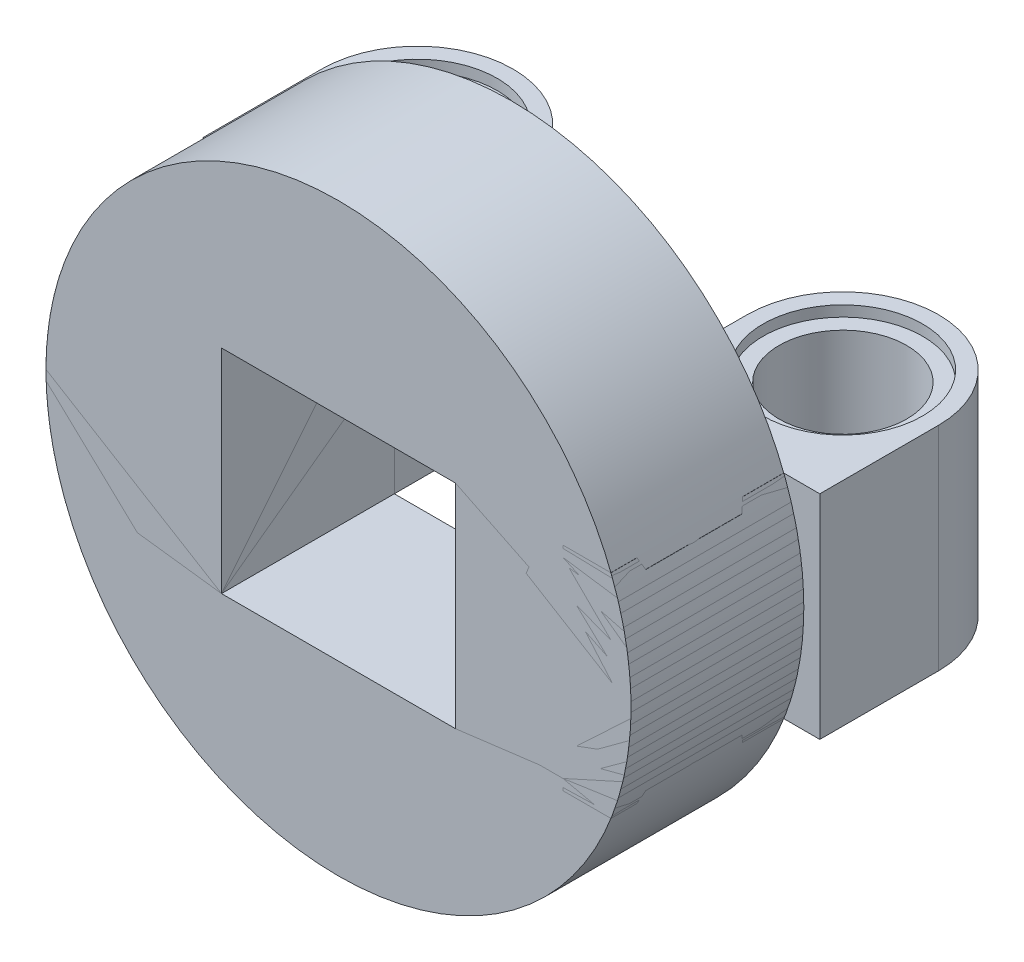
ISO-10303-21;
HEADER;
FILE_DESCRIPTION(('STEP AP214'),'2;1');
FILE_NAME('part.step','',(''),(''),'','','');
FILE_SCHEMA(('AUTOMOTIVE_DESIGN { 1 0 10303 214 1 1 1 1 }'));
ENDSEC;
DATA;
#1=APPLICATION_CONTEXT('core data for automotive mechanical design processes');
#2=APPLICATION_PROTOCOL_DEFINITION('international standard','automotive_design',2000,#1);
#3=PRODUCT_CONTEXT('',#1,'mechanical');
#4=PRODUCT('Part','Part','',(#3));
#5=PRODUCT_RELATED_PRODUCT_CATEGORY('part','',(#4));
#6=PRODUCT_DEFINITION_FORMATION('','',#4);
#7=PRODUCT_DEFINITION_CONTEXT('part definition',#1,'design');
#8=PRODUCT_DEFINITION('design','',#6,#7);
#9=PRODUCT_DEFINITION_SHAPE('','',#8);
#10=(LENGTH_UNIT() NAMED_UNIT(*) SI_UNIT(.MILLI.,.METRE.));
#11=(NAMED_UNIT(*) PLANE_ANGLE_UNIT() SI_UNIT($,.RADIAN.));
#12=(NAMED_UNIT(*) SI_UNIT($,.STERADIAN.) SOLID_ANGLE_UNIT());
#13=UNCERTAINTY_MEASURE_WITH_UNIT(LENGTH_MEASURE(1.E-05),#10,'distance_accuracy_value','');
#14=(GEOMETRIC_REPRESENTATION_CONTEXT(3) GLOBAL_UNCERTAINTY_ASSIGNED_CONTEXT((#13)) GLOBAL_UNIT_ASSIGNED_CONTEXT((#10,
#11,#12)) REPRESENTATION_CONTEXT('',''));
#15=CARTESIAN_POINT('',(0.,0.,0.));
#16=DIRECTION('',(0.,0.,1.));
#17=DIRECTION('',(1.,0.,0.));
#18=AXIS2_PLACEMENT_3D('',#15,#16,#17);
#19=CARTESIAN_POINT('',(0.,0.,3.5325));
#20=DIRECTION('',(0.,0.,-1.));
#21=DIRECTION('',(-1.,0.,0.));
#22=AXIS2_PLACEMENT_3D('',#19,#20,#21);
#23=CYLINDRICAL_SURFACE('',#22,11.);
#24=CARTESIAN_POINT('',(0.,0.,-3.5325));
#25=DIRECTION('',(0.,0.,1.));
#26=DIRECTION('',(1.,0.,0.));
#27=AXIS2_PLACEMENT_3D('',#24,#25,#26);
#28=CIRCLE('',#27,11.);
#29=CARTESIAN_POINT('',(11.,0.,-3.5325));
#30=VERTEX_POINT('',#29);
#31=EDGE_CURVE('E102',#30,#30,#28,.T.);
#32=ORIENTED_EDGE('',*,*,#31,.T.);
#33=EDGE_LOOP('',(#32));
#34=FACE_BOUND('',#33,.T.);
#35=CARTESIAN_POINT('',(0.,0.,2.9675));
#36=DIRECTION('',(0.,0.,1.));
#37=DIRECTION('',(1.,0.,0.));
#38=AXIS2_PLACEMENT_3D('',#35,#36,#37);
#39=CIRCLE('',#38,11.);
#40=CARTESIAN_POINT('',(11.,0.,2.9675));
#41=VERTEX_POINT('',#40);
#42=EDGE_CURVE('E122',#41,#41,#39,.T.);
#43=ORIENTED_EDGE('',*,*,#42,.F.);
#44=EDGE_LOOP('',(#43));
#45=FACE_BOUND('',#44,.T.);
#46=ADVANCED_FACE('F43',(#34,#45),#23,.T.);
#47=CARTESIAN_POINT('',(4.4,-4.,-6.4675));
#48=DIRECTION('',(1.,0.,0.));
#49=DIRECTION('',(0.,0.,-1.));
#50=AXIS2_PLACEMENT_3D('',#47,#48,#49);
#51=PLANE('',#50);
#52=DIRECTION('',(0.,-1.,0.));
#53=VECTOR('',#52,1.);
#54=CARTESIAN_POINT('',(4.4,-4.,2.9675));
#55=LINE('',#54,#53);
#56=CARTESIAN_POINT('',(4.4,4.,2.9675));
#57=VERTEX_POINT('',#56);
#58=CARTESIAN_POINT('',(4.4,-4.,2.9675));
#59=VERTEX_POINT('',#58);
#60=EDGE_CURVE('E81',#57,#59,#55,.T.);
#61=ORIENTED_EDGE('',*,*,#60,.F.);
#62=DIRECTION('',(0.,0.,1.));
#63=VECTOR('',#62,1.);
#64=CARTESIAN_POINT('',(4.4,4.,-6.4675));
#65=LINE('',#64,#63);
#66=CARTESIAN_POINT('',(4.4,4.,-3.5325));
#67=VERTEX_POINT('',#66);
#68=EDGE_CURVE('E88',#67,#57,#65,.T.);
#69=ORIENTED_EDGE('',*,*,#68,.F.);
#70=DIRECTION('',(0.,1.,0.));
#71=VECTOR('',#70,1.);
#72=CARTESIAN_POINT('',(4.4,0.,-3.5325));
#73=LINE('',#72,#71);
#74=CARTESIAN_POINT('',(4.4,-4.,-3.5325));
#75=VERTEX_POINT('',#74);
#76=EDGE_CURVE('E50',#75,#67,#73,.T.);
#77=ORIENTED_EDGE('',*,*,#76,.F.);
#78=DIRECTION('',(0.,0.,1.));
#79=VECTOR('',#78,1.);
#80=CARTESIAN_POINT('',(4.4,-4.,-6.4675));
#81=LINE('',#80,#79);
#82=EDGE_CURVE('E91',#75,#59,#81,.T.);
#83=ORIENTED_EDGE('',*,*,#82,.T.);
#84=EDGE_LOOP('',(#61,#69,#77,#83));
#85=FACE_BOUND('',#84,.T.);
#86=ADVANCED_FACE('F87',(#85),#51,.F.);
#87=CARTESIAN_POINT('',(-4.4,-4.,-6.4675));
#88=DIRECTION('',(0.,-1.,0.));
#89=DIRECTION('',(0.,0.,-1.));
#90=AXIS2_PLACEMENT_3D('',#87,#88,#89);
#91=PLANE('',#90);
#92=DIRECTION('',(-1.,0.,0.));
#93=VECTOR('',#92,1.);
#94=CARTESIAN_POINT('',(-4.4,-4.,2.9675));
#95=LINE('',#94,#93);
#96=CARTESIAN_POINT('',(-4.4,-4.,2.9675));
#97=VERTEX_POINT('',#96);
#98=EDGE_CURVE('E92',#59,#97,#95,.T.);
#99=ORIENTED_EDGE('',*,*,#98,.F.);
#100=ORIENTED_EDGE('',*,*,#82,.F.);
#101=DIRECTION('',(1.,0.,0.));
#102=VECTOR('',#101,1.);
#103=CARTESIAN_POINT('',(0.,-4.,-3.5325));
#104=LINE('',#103,#102);
#105=CARTESIAN_POINT('',(-4.4,-4.,-3.5325));
#106=VERTEX_POINT('',#105);
#107=EDGE_CURVE('E109',#106,#75,#104,.T.);
#108=ORIENTED_EDGE('',*,*,#107,.F.);
#109=DIRECTION('',(0.,0.,1.));
#110=VECTOR('',#109,1.);
#111=CARTESIAN_POINT('',(-4.4,-4.,-6.4675));
#112=LINE('',#111,#110);
#113=EDGE_CURVE('E98',#106,#97,#112,.T.);
#114=ORIENTED_EDGE('',*,*,#113,.T.);
#115=EDGE_LOOP('',(#99,#100,#108,#114));
#116=FACE_BOUND('',#115,.T.);
#117=ADVANCED_FACE('F115',(#116),#91,.F.);
#118=CARTESIAN_POINT('',(-4.4,-4.,-6.4675));
#119=DIRECTION('',(-1.,0.,0.));
#120=DIRECTION('',(0.,0.,1.));
#121=AXIS2_PLACEMENT_3D('',#118,#119,#120);
#122=PLANE('',#121);
#123=DIRECTION('',(0.,1.,0.));
#124=VECTOR('',#123,1.);
#125=CARTESIAN_POINT('',(-4.4,-4.,2.9675));
#126=LINE('',#125,#124);
#127=CARTESIAN_POINT('',(-4.4,4.,2.9675));
#128=VERTEX_POINT('',#127);
#129=EDGE_CURVE('E56',#97,#128,#126,.T.);
#130=ORIENTED_EDGE('',*,*,#129,.F.);
#131=ORIENTED_EDGE('',*,*,#113,.F.);
#132=DIRECTION('',(0.,-1.,0.));
#133=VECTOR('',#132,1.);
#134=CARTESIAN_POINT('',(-4.4,0.,-3.5325));
#135=LINE('',#134,#133);
#136=CARTESIAN_POINT('',(-4.4,4.,-3.5325));
#137=VERTEX_POINT('',#136);
#138=EDGE_CURVE('E106',#137,#106,#135,.T.);
#139=ORIENTED_EDGE('',*,*,#138,.F.);
#140=DIRECTION('',(0.,0.,1.));
#141=VECTOR('',#140,1.);
#142=CARTESIAN_POINT('',(-4.4,4.,-6.4675));
#143=LINE('',#142,#141);
#144=EDGE_CURVE('E63',#137,#128,#143,.T.);
#145=ORIENTED_EDGE('',*,*,#144,.T.);
#146=EDGE_LOOP('',(#130,#131,#139,#145));
#147=FACE_BOUND('',#146,.T.);
#148=ADVANCED_FACE('F140',(#147),#122,.F.);
#149=CARTESIAN_POINT('',(-4.4,4.,-6.4675));
#150=DIRECTION('',(0.,1.,0.));
#151=DIRECTION('',(0.,0.,1.));
#152=AXIS2_PLACEMENT_3D('',#149,#150,#151);
#153=PLANE('',#152);
#154=DIRECTION('',(1.,0.,0.));
#155=VECTOR('',#154,1.);
#156=CARTESIAN_POINT('',(-4.4,4.,2.9675));
#157=LINE('',#156,#155);
#158=EDGE_CURVE('E12',#128,#57,#157,.T.);
#159=ORIENTED_EDGE('',*,*,#158,.F.);
#160=ORIENTED_EDGE('',*,*,#144,.F.);
#161=DIRECTION('',(-1.,0.,0.));
#162=VECTOR('',#161,1.);
#163=CARTESIAN_POINT('',(0.,4.,-3.5325));
#164=LINE('',#163,#162);
#165=EDGE_CURVE('E96',#67,#137,#164,.T.);
#166=ORIENTED_EDGE('',*,*,#165,.F.);
#167=ORIENTED_EDGE('',*,*,#68,.T.);
#168=EDGE_LOOP('',(#159,#160,#166,#167));
#169=FACE_BOUND('',#168,.T.);
#170=ADVANCED_FACE('F94',(#169),#153,.F.);
#171=CARTESIAN_POINT('',(0.,0.,-3.5325));
#172=DIRECTION('',(0.,0.,1.));
#173=DIRECTION('',(1.,0.,0.));
#174=AXIS2_PLACEMENT_3D('',#171,#172,#173);
#175=PLANE('',#174);
#176=ORIENTED_EDGE('',*,*,#107,.T.);
#177=ORIENTED_EDGE('',*,*,#76,.T.);
#178=ORIENTED_EDGE('',*,*,#165,.T.);
#179=ORIENTED_EDGE('',*,*,#138,.T.);
#180=EDGE_LOOP('',(#176,#177,#178,#179));
#181=FACE_BOUND('',#180,.T.);
#182=ORIENTED_EDGE('',*,*,#31,.F.);
#183=EDGE_LOOP('',(#182));
#184=FACE_BOUND('',#183,.T.);
#185=ADVANCED_FACE('F112',(#181,#184),#175,.F.);
#186=CARTESIAN_POINT('',(0.,0.,2.9675));
#187=DIRECTION('',(0.,0.,1.));
#188=DIRECTION('',(1.,0.,0.));
#189=AXIS2_PLACEMENT_3D('',#186,#187,#188);
#190=PLANE('',#189);
#191=ORIENTED_EDGE('',*,*,#42,.T.);
#192=EDGE_LOOP('',(#191));
#193=FACE_BOUND('',#192,.T.);
#194=ORIENTED_EDGE('',*,*,#60,.T.);
#195=ORIENTED_EDGE('',*,*,#98,.T.);
#196=ORIENTED_EDGE('',*,*,#129,.T.);
#197=ORIENTED_EDGE('',*,*,#158,.T.);
#198=EDGE_LOOP('',(#194,#195,#196,#197));
#199=FACE_BOUND('',#198,.T.);
#200=ADVANCED_FACE('F80',(#193,#199),#190,.T.);
#201=CLOSED_SHELL('',(#46,#86,#117,#148,#170,#185,#200));
#202=MANIFOLD_SOLID_BREP('B2',#201);
#203=CARTESIAN_POINT('',(-4.40000000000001,-4.,8.));
#204=DIRECTION('',(1.,0.,0.));
#205=DIRECTION('',(0.,0.,-1.));
#206=AXIS2_PLACEMENT_3D('',#203,#204,#205);
#207=PLANE('',#206);
#208=DIRECTION('',(0.,0.,-1.));
#209=VECTOR('',#208,1.);
#210=CARTESIAN_POINT('',(-4.40000000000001,4.,8.));
#211=LINE('',#210,#209);
#212=CARTESIAN_POINT('',(-4.4,4.,2.9675));
#213=VERTEX_POINT('',#212);
#214=CARTESIAN_POINT('',(-4.4,4.,-8.));
#215=VERTEX_POINT('',#214);
#216=EDGE_CURVE('E388',#213,#215,#211,.T.);
#217=ORIENTED_EDGE('',*,*,#216,.F.);
#218=DIRECTION('',(0.,-1.,0.));
#219=VECTOR('',#218,1.);
#220=CARTESIAN_POINT('',(-4.40000000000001,-4.,2.9675));
#221=LINE('',#220,#219);
#222=CARTESIAN_POINT('',(-4.40000000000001,-4.,2.9675));
#223=VERTEX_POINT('',#222);
#224=EDGE_CURVE('E525',#213,#223,#221,.T.);
#225=ORIENTED_EDGE('',*,*,#224,.T.);
#226=DIRECTION('',(0.,0.,-1.));
#227=VECTOR('',#226,1.);
#228=CARTESIAN_POINT('',(-4.40000000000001,-4.,8.));
#229=LINE('',#228,#227);
#230=CARTESIAN_POINT('',(-4.4,-4.,-8.));
#231=VERTEX_POINT('',#230);
#232=EDGE_CURVE('E389',#223,#231,#229,.T.);
#233=ORIENTED_EDGE('',*,*,#232,.T.);
#234=DIRECTION('',(0.,1.,0.));
#235=VECTOR('',#234,1.);
#236=CARTESIAN_POINT('',(-4.4,-4.,-8.));
#237=LINE('',#236,#235);
#238=EDGE_CURVE('E398',#231,#215,#237,.T.);
#239=ORIENTED_EDGE('',*,*,#238,.T.);
#240=EDGE_LOOP('',(#217,#225,#233,#239));
#241=FACE_BOUND('',#240,.T.);
#242=ADVANCED_FACE('F197',(#241),#207,.T.);
#243=CARTESIAN_POINT('',(-8.00000000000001,-4.,8.));
#244=DIRECTION('',(0.,1.,0.));
#245=DIRECTION('',(1.,0.,0.));
#246=AXIS2_PLACEMENT_3D('',#243,#244,#245);
#247=PLANE('',#246);
#248=DIRECTION('',(1.,0.,0.));
#249=VECTOR('',#248,1.);
#250=CARTESIAN_POINT('',(-8.00000000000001,-4.,2.9675));
#251=LINE('',#250,#249);
#252=CARTESIAN_POINT('',(-10.2469507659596,-4.,2.9675));
#253=VERTEX_POINT('',#252);
#254=CARTESIAN_POINT('',(-8.44039045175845,-4.,2.9675));
#255=VERTEX_POINT('',#254);
#256=EDGE_CURVE('E310',#253,#255,#251,.T.);
#257=ORIENTED_EDGE('',*,*,#256,.F.);
#258=DIRECTION('',(0.,0.,-1.));
#259=VECTOR('',#258,1.);
#260=CARTESIAN_POINT('',(-10.2469507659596,-4.,-14.3632259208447));
#261=LINE('',#260,#259);
#262=CARTESIAN_POINT('',(-10.2469507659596,-4.,1.98776564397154));
#263=VERTEX_POINT('',#262);
#264=EDGE_CURVE('E322',#253,#263,#261,.T.);
#265=ORIENTED_EDGE('',*,*,#264,.T.);
#266=CARTESIAN_POINT('',(-8.00000000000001,-4.,0.));
#267=DIRECTION('',(0.,-1.,0.));
#268=DIRECTION('',(-1.,0.,0.));
#269=AXIS2_PLACEMENT_3D('',#266,#267,#268);
#270=CIRCLE('',#269,3.);
#271=EDGE_CURVE('E324',#255,#263,#270,.T.);
#272=ORIENTED_EDGE('',*,*,#271,.F.);
#273=EDGE_LOOP('',(#257,#265,#272));
#274=FACE_BOUND('',#273,.T.);
#275=ADVANCED_FACE('F321',(#274),#247,.F.);
#276=CARTESIAN_POINT('',(-8.00000000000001,-4.,-8.));
#277=DIRECTION('',(0.,-1.,0.));
#278=DIRECTION('',(-1.,0.,0.));
#279=AXIS2_PLACEMENT_3D('',#276,#277,#278);
#280=CIRCLE('',#279,3.);
#281=CARTESIAN_POINT('',(-11.,-4.,-8.));
#282=VERTEX_POINT('',#281);
#283=EDGE_CURVE('E382',#282,#282,#280,.T.);
#284=ORIENTED_EDGE('',*,*,#283,.F.);
#285=EDGE_LOOP('',(#284));
#286=FACE_BOUND('',#285,.T.);
#287=CARTESIAN_POINT('',(-7.55960954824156,-4.,2.9675));
#288=VERTEX_POINT('',#287);
#289=EDGE_CURVE('E328',#288,#223,#251,.T.);
#290=ORIENTED_EDGE('',*,*,#289,.F.);
#291=CARTESIAN_POINT('',(-10.2469507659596,-4.,-1.98776564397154));
#292=VERTEX_POINT('',#291);
#293=EDGE_CURVE('E363',#292,#288,#270,.T.);
#294=ORIENTED_EDGE('',*,*,#293,.F.);
#295=CARTESIAN_POINT('',(-10.2469507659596,-4.,-3.5325));
#296=VERTEX_POINT('',#295);
#297=EDGE_CURVE('E334',#292,#296,#261,.T.);
#298=ORIENTED_EDGE('',*,*,#297,.T.);
#299=DIRECTION('',(-1.,0.,0.));
#300=VECTOR('',#299,1.);
#301=CARTESIAN_POINT('',(-8.00000000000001,-4.,-3.5325));
#302=LINE('',#301,#300);
#303=CARTESIAN_POINT('',(-11.6,-4.,-3.5325));
#304=VERTEX_POINT('',#303);
#305=EDGE_CURVE('E336',#296,#304,#302,.T.);
#306=ORIENTED_EDGE('',*,*,#305,.T.);
#307=DIRECTION('',(0.,0.,1.));
#308=VECTOR('',#307,1.);
#309=CARTESIAN_POINT('',(-11.6,-4.,-8.));
#310=LINE('',#309,#308);
#311=CARTESIAN_POINT('',(-11.6,-4.,-8.));
#312=VERTEX_POINT('',#311);
#313=EDGE_CURVE('E395',#312,#304,#310,.T.);
#314=ORIENTED_EDGE('',*,*,#313,.F.);
#315=CARTESIAN_POINT('',(-8.00000000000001,-4.,-8.));
#316=DIRECTION('',(0.,1.,0.));
#317=DIRECTION('',(1.,0.,0.));
#318=AXIS2_PLACEMENT_3D('',#315,#316,#317);
#319=CIRCLE('',#318,3.6);
#320=EDGE_CURVE('E391',#231,#312,#319,.T.);
#321=ORIENTED_EDGE('',*,*,#320,.F.);
#322=ORIENTED_EDGE('',*,*,#232,.F.);
#323=EDGE_LOOP('',(#290,#294,#298,#306,#314,#321,#322));
#324=FACE_BOUND('',#323,.T.);
#325=ADVANCED_FACE('F505',(#286,#324),#247,.F.);
#326=CARTESIAN_POINT('',(-8.00000000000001,4.,8.));
#327=DIRECTION('',(0.,1.,0.));
#328=DIRECTION('',(1.,0.,0.));
#329=AXIS2_PLACEMENT_3D('',#326,#327,#328);
#330=PLANE('',#329);
#331=DIRECTION('',(0.,0.,-1.));
#332=VECTOR('',#331,1.);
#333=CARTESIAN_POINT('',(-10.2469507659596,4.,-14.3632259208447));
#334=LINE('',#333,#332);
#335=CARTESIAN_POINT('',(-10.2469507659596,4.,2.9675));
#336=VERTEX_POINT('',#335);
#337=CARTESIAN_POINT('',(-10.2469507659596,4.,1.98776564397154));
#338=VERTEX_POINT('',#337);
#339=EDGE_CURVE('E424',#336,#338,#334,.T.);
#340=ORIENTED_EDGE('',*,*,#339,.F.);
#341=DIRECTION('',(1.,0.,0.));
#342=VECTOR('',#341,1.);
#343=CARTESIAN_POINT('',(-8.00000000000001,4.,2.9675));
#344=LINE('',#343,#342);
#345=CARTESIAN_POINT('',(-8.44039045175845,4.,2.9675));
#346=VERTEX_POINT('',#345);
#347=EDGE_CURVE('E211',#336,#346,#344,.T.);
#348=ORIENTED_EDGE('',*,*,#347,.T.);
#349=CARTESIAN_POINT('',(-8.00000000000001,4.,0.));
#350=DIRECTION('',(0.,-1.,0.));
#351=DIRECTION('',(-1.,0.,0.));
#352=AXIS2_PLACEMENT_3D('',#349,#350,#351);
#353=CIRCLE('',#352,3.);
#354=EDGE_CURVE('E366',#346,#338,#353,.T.);
#355=ORIENTED_EDGE('',*,*,#354,.T.);
#356=EDGE_LOOP('',(#340,#348,#355));
#357=FACE_BOUND('',#356,.T.);
#358=ADVANCED_FACE('F506',(#357),#330,.T.);
#359=CARTESIAN_POINT('',(-8.00000000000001,4.,-8.));
#360=DIRECTION('',(0.,-1.,0.));
#361=DIRECTION('',(-1.,0.,0.));
#362=AXIS2_PLACEMENT_3D('',#359,#360,#361);
#363=CIRCLE('',#362,3.);
#364=CARTESIAN_POINT('',(-11.,4.,-8.));
#365=VERTEX_POINT('',#364);
#366=EDGE_CURVE('E385',#365,#365,#363,.T.);
#367=ORIENTED_EDGE('',*,*,#366,.T.);
#368=EDGE_LOOP('',(#367));
#369=FACE_BOUND('',#368,.T.);
#370=CARTESIAN_POINT('',(-10.2469507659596,4.,-1.98776564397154));
#371=VERTEX_POINT('',#370);
#372=CARTESIAN_POINT('',(-7.55960954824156,4.,2.9675));
#373=VERTEX_POINT('',#372);
#374=EDGE_CURVE('E367',#371,#373,#353,.T.);
#375=ORIENTED_EDGE('',*,*,#374,.T.);
#376=EDGE_CURVE('E531',#373,#213,#344,.T.);
#377=ORIENTED_EDGE('',*,*,#376,.T.);
#378=ORIENTED_EDGE('',*,*,#216,.T.);
#379=CARTESIAN_POINT('',(-8.00000000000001,4.,-8.));
#380=DIRECTION('',(0.,1.,0.));
#381=DIRECTION('',(1.,0.,0.));
#382=AXIS2_PLACEMENT_3D('',#379,#380,#381);
#383=CIRCLE('',#382,3.6);
#384=CARTESIAN_POINT('',(-11.6,4.,-8.));
#385=VERTEX_POINT('',#384);
#386=EDGE_CURVE('E400',#215,#385,#383,.T.);
#387=ORIENTED_EDGE('',*,*,#386,.T.);
#388=DIRECTION('',(0.,0.,1.));
#389=VECTOR('',#388,1.);
#390=CARTESIAN_POINT('',(-11.6,4.,-8.));
#391=LINE('',#390,#389);
#392=CARTESIAN_POINT('',(-11.6,4.,-3.5325));
#393=VERTEX_POINT('',#392);
#394=EDGE_CURVE('E392',#385,#393,#391,.T.);
#395=ORIENTED_EDGE('',*,*,#394,.T.);
#396=DIRECTION('',(-1.,0.,0.));
#397=VECTOR('',#396,1.);
#398=CARTESIAN_POINT('',(-8.00000000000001,4.,-3.5325));
#399=LINE('',#398,#397);
#400=CARTESIAN_POINT('',(-10.2469507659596,4.,-3.5325));
#401=VERTEX_POINT('',#400);
#402=EDGE_CURVE('E41',#401,#393,#399,.T.);
#403=ORIENTED_EDGE('',*,*,#402,.F.);
#404=EDGE_CURVE('E562',#371,#401,#334,.T.);
#405=ORIENTED_EDGE('',*,*,#404,.F.);
#406=EDGE_LOOP('',(#375,#377,#378,#387,#395,#403,#405));
#407=FACE_BOUND('',#406,.T.);
#408=ADVANCED_FACE('F480',(#369,#407),#330,.T.);
#409=CARTESIAN_POINT('',(-8.00000000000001,4.,0.));
#410=DIRECTION('',(0.,-1.,0.));
#411=DIRECTION('',(-1.,0.,0.));
#412=AXIS2_PLACEMENT_3D('',#409,#410,#411);
#413=CYLINDRICAL_SURFACE('',#412,3.);
#414=DIRECTION('',(0.,-1.,0.));
#415=VECTOR('',#414,1.);
#416=CARTESIAN_POINT('',(-8.44039045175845,4.,2.9675));
#417=LINE('',#416,#415);
#418=CARTESIAN_POINT('',(-8.44039045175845,3.6,2.9675));
#419=VERTEX_POINT('',#418);
#420=EDGE_CURVE('E535',#419,#346,#417,.F.);
#421=ORIENTED_EDGE('',*,*,#420,.F.);
#422=CARTESIAN_POINT('',(-8.00000000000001,3.6,0.));
#423=DIRECTION('',(0.,-1.,0.));
#424=DIRECTION('',(-1.,0.,0.));
#425=AXIS2_PLACEMENT_3D('',#422,#423,#424);
#426=CIRCLE('',#425,3.);
#427=CARTESIAN_POINT('',(-10.394229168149,3.6,1.80766885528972));
#428=VERTEX_POINT('',#427);
#429=EDGE_CURVE('E219',#419,#428,#426,.T.);
#430=ORIENTED_EDGE('',*,*,#429,.T.);
#431=CARTESIAN_POINT('',(-10.394229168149,3.6,1.80766885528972));
#432=CARTESIAN_POINT('',(-10.3710731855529,3.66687442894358,1.83836058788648));
#433=CARTESIAN_POINT('',(-10.347221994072,3.73364497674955,1.86871451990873));
#434=CARTESIAN_POINT('',(-10.2981291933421,3.86697831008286,1.92874678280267));
#435=CARTESIAN_POINT('',(-10.2728875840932,3.93354109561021,1.95842511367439));
#436=CARTESIAN_POINT('',(-10.2469507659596,3.99999999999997,1.98776564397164));
#437=B_SPLINE_CURVE_WITH_KNOTS('',3,(#431,#432,#433,#434,#435,#436),.UNSPECIFIED.,.F.,.F.,(4,2,
4),(0.,0.231380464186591,0.462760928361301),.UNSPECIFIED.);
#438=EDGE_CURVE('E422',#428,#338,#437,.T.);
#439=ORIENTED_EDGE('',*,*,#438,.T.);
#440=ORIENTED_EDGE('',*,*,#354,.F.);
#441=EDGE_LOOP('',(#421,#430,#439,#440));
#442=FACE_BOUND('',#441,.T.);
#443=ADVANCED_FACE('F475',(#442),#413,.F.);
#444=DIRECTION('',(0.,-1.,0.));
#445=VECTOR('',#444,1.);
#446=CARTESIAN_POINT('',(-7.55960954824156,4.,2.9675));
#447=LINE('',#446,#445);
#448=CARTESIAN_POINT('',(-7.55960954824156,3.6,2.9675));
#449=VERTEX_POINT('',#448);
#450=EDGE_CURVE('E537',#373,#449,#447,.T.);
#451=ORIENTED_EDGE('',*,*,#450,.F.);
#452=ORIENTED_EDGE('',*,*,#374,.F.);
#453=CARTESIAN_POINT('',(-10.2469507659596,4.,-1.98776564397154));
#454=CARTESIAN_POINT('',(-10.2728875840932,3.93354109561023,-1.95842511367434));
#455=CARTESIAN_POINT('',(-10.2981291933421,3.86697831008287,-1.92874678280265));
#456=CARTESIAN_POINT('',(-10.347221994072,3.73364497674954,-1.86871451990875));
#457=CARTESIAN_POINT('',(-10.3710731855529,3.66687442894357,-1.83836058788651));
#458=CARTESIAN_POINT('',(-10.394229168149,3.59999999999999,-1.80766885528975));
#459=B_SPLINE_CURVE_WITH_KNOTS('',3,(#453,#454,#455,#456,#457,#458),.UNSPECIFIED.,.F.,.F.,(4,2,
4),(0.,0.231380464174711,0.462760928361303),.UNSPECIFIED.);
#460=CARTESIAN_POINT('',(-10.394229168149,3.6,-1.80766885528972));
#461=VERTEX_POINT('',#460);
#462=EDGE_CURVE('E453',#371,#461,#459,.T.);
#463=ORIENTED_EDGE('',*,*,#462,.T.);
#464=EDGE_CURVE('E350',#461,#449,#426,.T.);
#465=ORIENTED_EDGE('',*,*,#464,.T.);
#466=EDGE_LOOP('',(#451,#452,#463,#465));
#467=FACE_BOUND('',#466,.T.);
#468=ADVANCED_FACE('F472',(#467),#413,.F.);
#469=CARTESIAN_POINT('',(-8.00000000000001,4.,0.));
#470=DIRECTION('',(0.,-1.,0.));
#471=DIRECTION('',(-1.,0.,0.));
#472=AXIS2_PLACEMENT_3D('',#469,#470,#471);
#473=CYLINDRICAL_SURFACE('',#472,3.);
#474=DIRECTION('',(0.,-1.,0.));
#475=VECTOR('',#474,1.);
#476=CARTESIAN_POINT('',(-8.44039045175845,4.,2.9675));
#477=LINE('',#476,#475);
#478=CARTESIAN_POINT('',(-8.44039045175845,-3.6,2.9675));
#479=VERTEX_POINT('',#478);
#480=EDGE_CURVE('E326',#255,#479,#477,.F.);
#481=ORIENTED_EDGE('',*,*,#480,.F.);
#482=ORIENTED_EDGE('',*,*,#271,.T.);
#483=CARTESIAN_POINT('',(-10.2469507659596,-4.,1.98776564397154));
#484=CARTESIAN_POINT('',(-10.2728875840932,-3.93354109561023,1.95842511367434));
#485=CARTESIAN_POINT('',(-10.2981291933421,-3.86697831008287,1.92874678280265));
#486=CARTESIAN_POINT('',(-10.347221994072,-3.73364497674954,1.86871451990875));
#487=CARTESIAN_POINT('',(-10.3710731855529,-3.66687442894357,1.83836058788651));
#488=CARTESIAN_POINT('',(-10.394229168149,-3.59999999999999,1.80766885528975));
#489=B_SPLINE_CURVE_WITH_KNOTS('',3,(#483,#484,#485,#486,#487,#488),.UNSPECIFIED.,.F.,.F.,(4,2,
4),(0.,0.231380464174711,0.462760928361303),.UNSPECIFIED.);
#490=CARTESIAN_POINT('',(-10.394229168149,-3.6,1.80766885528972));
#491=VERTEX_POINT('',#490);
#492=EDGE_CURVE('E332',#263,#491,#489,.T.);
#493=ORIENTED_EDGE('',*,*,#492,.T.);
#494=CARTESIAN_POINT('',(-8.00000000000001,-3.6,0.));
#495=DIRECTION('',(0.,-1.,0.));
#496=DIRECTION('',(-1.,0.,0.));
#497=AXIS2_PLACEMENT_3D('',#494,#495,#496);
#498=CIRCLE('',#497,3.);
#499=EDGE_CURVE('E359',#479,#491,#498,.T.);
#500=ORIENTED_EDGE('',*,*,#499,.F.);
#501=EDGE_LOOP('',(#481,#482,#493,#500));
#502=FACE_BOUND('',#501,.T.);
#503=ADVANCED_FACE('F468',(#502),#473,.F.);
#504=DIRECTION('',(0.,-1.,0.));
#505=VECTOR('',#504,1.);
#506=CARTESIAN_POINT('',(-7.55960954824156,4.,2.9675));
#507=LINE('',#506,#505);
#508=CARTESIAN_POINT('',(-7.55960954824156,-3.6,2.9675));
#509=VERTEX_POINT('',#508);
#510=EDGE_CURVE('E542',#509,#288,#507,.T.);
#511=ORIENTED_EDGE('',*,*,#510,.F.);
#512=CARTESIAN_POINT('',(-10.394229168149,-3.6,-1.80766885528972));
#513=VERTEX_POINT('',#512);
#514=EDGE_CURVE('E360',#513,#509,#498,.T.);
#515=ORIENTED_EDGE('',*,*,#514,.F.);
#516=CARTESIAN_POINT('',(-10.394229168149,-3.6,-1.80766885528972));
#517=CARTESIAN_POINT('',(-10.3710731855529,-3.66687442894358,-1.83836058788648));
#518=CARTESIAN_POINT('',(-10.347221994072,-3.73364497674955,-1.86871451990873));
#519=CARTESIAN_POINT('',(-10.2981291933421,-3.86697831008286,-1.92874678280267));
#520=CARTESIAN_POINT('',(-10.2728875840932,-3.93354109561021,-1.95842511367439));
#521=CARTESIAN_POINT('',(-10.2469507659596,-3.99999999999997,-1.98776564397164));
#522=B_SPLINE_CURVE_WITH_KNOTS('',3,(#516,#517,#518,#519,#520,#521),.UNSPECIFIED.,.F.,.F.,(4,2,
4),(0.,0.231380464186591,0.462760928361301),.UNSPECIFIED.);
#523=EDGE_CURVE('E339',#513,#292,#522,.T.);
#524=ORIENTED_EDGE('',*,*,#523,.T.);
#525=ORIENTED_EDGE('',*,*,#293,.T.);
#526=EDGE_LOOP('',(#511,#515,#524,#525));
#527=FACE_BOUND('',#526,.T.);
#528=ADVANCED_FACE('F471',(#527),#473,.F.);
#529=CARTESIAN_POINT('',(-8.00000000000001,-3.6,-3.));
#530=DIRECTION('',(0.,1.,0.));
#531=DIRECTION('',(1.,0.,0.));
#532=AXIS2_PLACEMENT_3D('',#529,#530,#531);
#533=PLANE('',#532);
#534=DIRECTION('',(1.,0.,0.));
#535=VECTOR('',#534,1.);
#536=CARTESIAN_POINT('',(-8.00000000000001,-3.6,2.9675));
#537=LINE('',#536,#535);
#538=EDGE_CURVE('E544',#479,#509,#537,.T.);
#539=ORIENTED_EDGE('',*,*,#538,.F.);
#540=ORIENTED_EDGE('',*,*,#499,.T.);
#541=DIRECTION('',(0.,0.,-1.));
#542=VECTOR('',#541,1.);
#543=CARTESIAN_POINT('',(-10.394229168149,-3.6,-14.3632259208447));
#544=LINE('',#543,#542);
#545=CARTESIAN_POINT('',(-10.394229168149,-3.6,0.166333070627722));
#546=VERTEX_POINT('',#545);
#547=EDGE_CURVE('E466',#491,#546,#544,.T.);
#548=ORIENTED_EDGE('',*,*,#547,.T.);
#549=CARTESIAN_POINT('',(-8.00000000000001,-3.6,0.));
#550=DIRECTION('',(0.,-1.,0.));
#551=DIRECTION('',(-1.,0.,0.));
#552=AXIS2_PLACEMENT_3D('',#549,#550,#551);
#553=CIRCLE('',#552,2.4);
#554=CARTESIAN_POINT('',(-10.394229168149,-3.6,-0.166333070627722));
#555=VERTEX_POINT('',#554);
#556=EDGE_CURVE('E356',#555,#546,#553,.T.);
#557=ORIENTED_EDGE('',*,*,#556,.F.);
#558=EDGE_CURVE('E467',#555,#513,#544,.T.);
#559=ORIENTED_EDGE('',*,*,#558,.T.);
#560=ORIENTED_EDGE('',*,*,#514,.T.);
#561=EDGE_LOOP('',(#539,#540,#548,#557,#559,#560));
#562=FACE_BOUND('',#561,.T.);
#563=ADVANCED_FACE('F474',(#562),#533,.F.);
#564=CARTESIAN_POINT('',(-8.00000000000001,3.6,-2.4));
#565=DIRECTION('',(0.,-1.,0.));
#566=DIRECTION('',(-1.,0.,0.));
#567=AXIS2_PLACEMENT_3D('',#564,#565,#566);
#568=PLANE('',#567);
#569=DIRECTION('',(-1.,0.,0.));
#570=VECTOR('',#569,1.);
#571=CARTESIAN_POINT('',(-8.00000000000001,3.6,2.9675));
#572=LINE('',#571,#570);
#573=EDGE_CURVE('E316',#449,#419,#572,.T.);
#574=ORIENTED_EDGE('',*,*,#573,.F.);
#575=ORIENTED_EDGE('',*,*,#464,.F.);
#576=DIRECTION('',(0.,0.,-1.));
#577=VECTOR('',#576,1.);
#578=CARTESIAN_POINT('',(-10.394229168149,3.6,-14.3632259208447));
#579=LINE('',#578,#577);
#580=CARTESIAN_POINT('',(-10.394229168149,3.6,-0.166333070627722));
#581=VERTEX_POINT('',#580);
#582=EDGE_CURVE('E204',#461,#581,#579,.F.);
#583=ORIENTED_EDGE('',*,*,#582,.T.);
#584=CARTESIAN_POINT('',(-8.00000000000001,3.6,0.));
#585=DIRECTION('',(0.,-1.,0.));
#586=DIRECTION('',(-1.,0.,0.));
#587=AXIS2_PLACEMENT_3D('',#584,#585,#586);
#588=CIRCLE('',#587,2.4);
#589=CARTESIAN_POINT('',(-10.394229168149,3.6,0.166333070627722));
#590=VERTEX_POINT('',#589);
#591=EDGE_CURVE('E353',#581,#590,#588,.T.);
#592=ORIENTED_EDGE('',*,*,#591,.T.);
#593=EDGE_CURVE('E407',#590,#428,#579,.F.);
#594=ORIENTED_EDGE('',*,*,#593,.T.);
#595=ORIENTED_EDGE('',*,*,#429,.F.);
#596=EDGE_LOOP('',(#574,#575,#583,#592,#594,#595));
#597=FACE_BOUND('',#596,.T.);
#598=ADVANCED_FACE('F415',(#597),#568,.F.);
#599=CARTESIAN_POINT('',(0.,0.,-14.3632259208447));
#600=DIRECTION('',(0.,0.,-1.));
#601=DIRECTION('',(-1.,0.,0.));
#602=AXIS2_PLACEMENT_3D('',#599,#600,#601);
#603=CYLINDRICAL_SURFACE('',#602,11.);
#604=CARTESIAN_POINT('',(0.,0.,2.9675));
#605=DIRECTION('',(0.,0.,1.));
#606=DIRECTION('',(1.,0.,0.));
#607=AXIS2_PLACEMENT_3D('',#604,#605,#606);
#608=CIRCLE('',#607,11.);
#609=EDGE_CURVE('E307',#336,#253,#608,.T.);
#610=ORIENTED_EDGE('',*,*,#609,.F.);
#611=ORIENTED_EDGE('',*,*,#339,.T.);
#612=ORIENTED_EDGE('',*,*,#438,.F.);
#613=ORIENTED_EDGE('',*,*,#593,.F.);
#614=CARTESIAN_POINT('',(-10.394229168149,3.6,-0.166333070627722));
#615=CARTESIAN_POINT('',(-10.3957740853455,3.59553864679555,-0.144105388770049));
#616=CARTESIAN_POINT('',(-10.3970188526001,3.59193637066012,-0.121689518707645));
#617=CARTESIAN_POINT('',(-10.3988830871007,3.58653578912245,-0.0766147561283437));
#618=CARTESIAN_POINT('',(-10.39950249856,3.58473764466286,-0.0539558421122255));
#619=CARTESIAN_POINT('',(-10.4003739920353,3.58221063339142,0.013340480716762));
#620=CARTESIAN_POINT('',(-10.399697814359,3.58417931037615,0.0581286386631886));
#621=CARTESIAN_POINT('',(-10.3969017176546,3.59227386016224,0.123855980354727));
#622=CARTESIAN_POINT('',(-10.3957046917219,3.59573655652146,0.145198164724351));
#623=CARTESIAN_POINT('',(-10.394229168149,3.60000000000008,0.166333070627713));
#624=B_SPLINE_CURVE_WITH_KNOTS('',3,(#614,#615,#616,#617,#618,#619,#620,#621,#622,#623),
.UNSPECIFIED.,.F.,.F.,(4,2,2,2,4),(0.,0.0681384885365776,0.13628305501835,0.270055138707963,
0.334932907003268),.UNSPECIFIED.);
#625=EDGE_CURVE('E421',#581,#590,#624,.T.);
#626=ORIENTED_EDGE('',*,*,#625,.F.);
#627=ORIENTED_EDGE('',*,*,#582,.F.);
#628=ORIENTED_EDGE('',*,*,#462,.F.);
#629=ORIENTED_EDGE('',*,*,#404,.T.);
#630=CARTESIAN_POINT('',(0.,0.,-3.5325));
#631=DIRECTION('',(0.,0.,-1.));
#632=DIRECTION('',(-1.,0.,0.));
#633=AXIS2_PLACEMENT_3D('',#630,#631,#632);
#634=CIRCLE('',#633,11.);
#635=EDGE_CURVE('E325',#296,#401,#634,.T.);
#636=ORIENTED_EDGE('',*,*,#635,.F.);
#637=ORIENTED_EDGE('',*,*,#297,.F.);
#638=ORIENTED_EDGE('',*,*,#523,.F.);
#639=ORIENTED_EDGE('',*,*,#558,.F.);
#640=CARTESIAN_POINT('',(-10.394229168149,-3.6,0.166333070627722));
#641=CARTESIAN_POINT('',(-10.3957740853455,-3.59553864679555,0.144105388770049));
#642=CARTESIAN_POINT('',(-10.3970188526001,-3.59193637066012,0.121689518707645));
#643=CARTESIAN_POINT('',(-10.3988830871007,-3.58653578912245,0.0766147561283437));
#644=CARTESIAN_POINT('',(-10.39950249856,-3.58473764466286,0.0539558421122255));
#645=CARTESIAN_POINT('',(-10.4003739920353,-3.58221063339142,-0.013340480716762));
#646=CARTESIAN_POINT('',(-10.399697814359,-3.58417931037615,-0.0581286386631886));
#647=CARTESIAN_POINT('',(-10.3969017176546,-3.59227386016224,-0.123855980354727));
#648=CARTESIAN_POINT('',(-10.3957046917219,-3.59573655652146,-0.145198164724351));
#649=CARTESIAN_POINT('',(-10.394229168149,-3.60000000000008,-0.166333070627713));
#650=B_SPLINE_CURVE_WITH_KNOTS('',3,(#640,#641,#642,#643,#644,#645,#646,#647,#648,#649),
.UNSPECIFIED.,.F.,.F.,(4,2,2,2,4),(0.,0.0681384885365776,0.13628305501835,0.270055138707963,
0.334932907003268),.UNSPECIFIED.);
#651=EDGE_CURVE('E458',#546,#555,#650,.T.);
#652=ORIENTED_EDGE('',*,*,#651,.F.);
#653=ORIENTED_EDGE('',*,*,#547,.F.);
#654=ORIENTED_EDGE('',*,*,#492,.F.);
#655=ORIENTED_EDGE('',*,*,#264,.F.);
#656=EDGE_LOOP('',(#610,#611,#612,#613,#626,#627,#628,#629,#636,#637,#638,#639,#652,#653,#654,#655));
#657=FACE_BOUND('',#656,.T.);
#658=ADVANCED_FACE('F329',(#657),#603,.T.);
#659=CARTESIAN_POINT('',(-11.6,-4.,-8.));
#660=DIRECTION('',(-1.,0.,0.));
#661=DIRECTION('',(0.,0.,1.));
#662=AXIS2_PLACEMENT_3D('',#659,#660,#661);
#663=PLANE('',#662);
#664=DIRECTION('',(0.,-1.,0.));
#665=VECTOR('',#664,1.);
#666=CARTESIAN_POINT('',(-11.6,-4.,-3.5325));
#667=LINE('',#666,#665);
#668=EDGE_CURVE('E333',#393,#304,#667,.T.);
#669=ORIENTED_EDGE('',*,*,#668,.F.);
#670=ORIENTED_EDGE('',*,*,#394,.F.);
#671=DIRECTION('',(0.,1.,0.));
#672=VECTOR('',#671,1.);
#673=CARTESIAN_POINT('',(-11.6,-4.,-8.));
#674=LINE('',#673,#672);
#675=EDGE_CURVE('E405',#312,#385,#674,.T.);
#676=ORIENTED_EDGE('',*,*,#675,.F.);
#677=ORIENTED_EDGE('',*,*,#313,.T.);
#678=EDGE_LOOP('',(#669,#670,#676,#677));
#679=FACE_BOUND('',#678,.T.);
#680=ADVANCED_FACE('F445',(#679),#663,.T.);
#681=CARTESIAN_POINT('',(-8.00000000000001,-4.,-8.));
#682=DIRECTION('',(0.,1.,0.));
#683=DIRECTION('',(1.,0.,0.));
#684=AXIS2_PLACEMENT_3D('',#681,#682,#683);
#685=CYLINDRICAL_SURFACE('',#684,3.6);
#686=ORIENTED_EDGE('',*,*,#386,.F.);
#687=ORIENTED_EDGE('',*,*,#238,.F.);
#688=ORIENTED_EDGE('',*,*,#320,.T.);
#689=ORIENTED_EDGE('',*,*,#675,.T.);
#690=EDGE_LOOP('',(#686,#687,#688,#689));
#691=FACE_BOUND('',#690,.T.);
#692=ADVANCED_FACE('F501',(#691),#685,.T.);
#693=CARTESIAN_POINT('',(-8.00000000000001,4.,-8.));
#694=DIRECTION('',(0.,-1.,0.));
#695=DIRECTION('',(-1.,0.,0.));
#696=AXIS2_PLACEMENT_3D('',#693,#694,#695);
#697=CYLINDRICAL_SURFACE('',#696,3.);
#698=ORIENTED_EDGE('',*,*,#366,.F.);
#699=EDGE_LOOP('',(#698));
#700=FACE_BOUND('',#699,.T.);
#701=CARTESIAN_POINT('',(-8.00000000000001,3.6,-8.));
#702=DIRECTION('',(0.,-1.,0.));
#703=DIRECTION('',(-1.,0.,0.));
#704=AXIS2_PLACEMENT_3D('',#701,#702,#703);
#705=CIRCLE('',#704,3.);
#706=CARTESIAN_POINT('',(-11.,3.6,-8.));
#707=VERTEX_POINT('',#706);
#708=EDGE_CURVE('E370',#707,#707,#705,.T.);
#709=ORIENTED_EDGE('',*,*,#708,.T.);
#710=EDGE_LOOP('',(#709));
#711=FACE_BOUND('',#710,.T.);
#712=ADVANCED_FACE('F497',(#700,#711),#697,.F.);
#713=CARTESIAN_POINT('',(-8.00000000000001,4.,-8.));
#714=DIRECTION('',(0.,-1.,0.));
#715=DIRECTION('',(-1.,0.,0.));
#716=AXIS2_PLACEMENT_3D('',#713,#714,#715);
#717=CYLINDRICAL_SURFACE('',#716,3.);
#718=CARTESIAN_POINT('',(-8.00000000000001,-3.6,-8.));
#719=DIRECTION('',(0.,-1.,0.));
#720=DIRECTION('',(-1.,0.,0.));
#721=AXIS2_PLACEMENT_3D('',#718,#719,#720);
#722=CIRCLE('',#721,3.);
#723=CARTESIAN_POINT('',(-11.,-3.6,-8.));
#724=VERTEX_POINT('',#723);
#725=EDGE_CURVE('E379',#724,#724,#722,.T.);
#726=ORIENTED_EDGE('',*,*,#725,.F.);
#727=EDGE_LOOP('',(#726));
#728=FACE_BOUND('',#727,.T.);
#729=ORIENTED_EDGE('',*,*,#283,.T.);
#730=EDGE_LOOP('',(#729));
#731=FACE_BOUND('',#730,.T.);
#732=ADVANCED_FACE('F493',(#728,#731),#717,.F.);
#733=CARTESIAN_POINT('',(-8.00000000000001,-3.6,-11.));
#734=DIRECTION('',(0.,1.,0.));
#735=DIRECTION('',(1.,0.,0.));
#736=AXIS2_PLACEMENT_3D('',#733,#734,#735);
#737=PLANE('',#736);
#738=CARTESIAN_POINT('',(-8.00000000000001,-3.6,-8.));
#739=DIRECTION('',(0.,-1.,0.));
#740=DIRECTION('',(-1.,0.,0.));
#741=AXIS2_PLACEMENT_3D('',#738,#739,#740);
#742=CIRCLE('',#741,2.4);
#743=CARTESIAN_POINT('',(-10.4,-3.6,-8.));
#744=VERTEX_POINT('',#743);
#745=EDGE_CURVE('E376',#744,#744,#742,.T.);
#746=ORIENTED_EDGE('',*,*,#745,.F.);
#747=EDGE_LOOP('',(#746));
#748=FACE_BOUND('',#747,.T.);
#749=ORIENTED_EDGE('',*,*,#725,.T.);
#750=EDGE_LOOP('',(#749));
#751=FACE_BOUND('',#750,.T.);
#752=ADVANCED_FACE('F489',(#748,#751),#737,.F.);
#753=CARTESIAN_POINT('',(-8.00000000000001,4.,-8.));
#754=DIRECTION('',(0.,-1.,0.));
#755=DIRECTION('',(-1.,0.,0.));
#756=AXIS2_PLACEMENT_3D('',#753,#754,#755);
#757=CYLINDRICAL_SURFACE('',#756,2.4);
#758=CARTESIAN_POINT('',(-8.00000000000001,3.6,-8.));
#759=DIRECTION('',(0.,-1.,0.));
#760=DIRECTION('',(-1.,0.,0.));
#761=AXIS2_PLACEMENT_3D('',#758,#759,#760);
#762=CIRCLE('',#761,2.4);
#763=CARTESIAN_POINT('',(-10.4,3.6,-8.));
#764=VERTEX_POINT('',#763);
#765=EDGE_CURVE('E373',#764,#764,#762,.T.);
#766=ORIENTED_EDGE('',*,*,#765,.F.);
#767=EDGE_LOOP('',(#766));
#768=FACE_BOUND('',#767,.T.);
#769=ORIENTED_EDGE('',*,*,#745,.T.);
#770=EDGE_LOOP('',(#769));
#771=FACE_BOUND('',#770,.T.);
#772=ADVANCED_FACE('F485',(#768,#771),#757,.F.);
#773=CARTESIAN_POINT('',(-8.00000000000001,3.6,-10.4));
#774=DIRECTION('',(0.,-1.,0.));
#775=DIRECTION('',(-1.,0.,0.));
#776=AXIS2_PLACEMENT_3D('',#773,#774,#775);
#777=PLANE('',#776);
#778=ORIENTED_EDGE('',*,*,#708,.F.);
#779=EDGE_LOOP('',(#778));
#780=FACE_BOUND('',#779,.T.);
#781=ORIENTED_EDGE('',*,*,#765,.T.);
#782=EDGE_LOOP('',(#781));
#783=FACE_BOUND('',#782,.T.);
#784=ADVANCED_FACE('F481',(#780,#783),#777,.F.);
#785=CARTESIAN_POINT('',(-8.00000000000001,4.,0.));
#786=DIRECTION('',(0.,-1.,0.));
#787=DIRECTION('',(-1.,0.,0.));
#788=AXIS2_PLACEMENT_3D('',#785,#786,#787);
#789=CYLINDRICAL_SURFACE('',#788,2.4);
#790=ORIENTED_EDGE('',*,*,#591,.F.);
#791=ORIENTED_EDGE('',*,*,#625,.T.);
#792=EDGE_LOOP('',(#790,#791));
#793=FACE_BOUND('',#792,.T.);
#794=ORIENTED_EDGE('',*,*,#556,.T.);
#795=ORIENTED_EDGE('',*,*,#651,.T.);
#796=EDGE_LOOP('',(#794,#795));
#797=FACE_BOUND('',#796,.T.);
#798=ADVANCED_FACE('F419',(#793,#797),#789,.F.);
#799=CARTESIAN_POINT('',(0.,16.3455536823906,-3.5325));
#800=DIRECTION('',(0.,0.,-1.));
#801=DIRECTION('',(-1.,0.,0.));
#802=AXIS2_PLACEMENT_3D('',#799,#800,#801);
#803=PLANE('',#802);
#804=ORIENTED_EDGE('',*,*,#635,.T.);
#805=ORIENTED_EDGE('',*,*,#402,.T.);
#806=ORIENTED_EDGE('',*,*,#668,.T.);
#807=ORIENTED_EDGE('',*,*,#305,.F.);
#808=EDGE_LOOP('',(#804,#805,#806,#807));
#809=FACE_BOUND('',#808,.T.);
#810=ADVANCED_FACE('F446',(#809),#803,.F.);
#811=CARTESIAN_POINT('',(0.,0.,2.9675));
#812=DIRECTION('',(0.,0.,1.));
#813=DIRECTION('',(1.,0.,0.));
#814=AXIS2_PLACEMENT_3D('',#811,#812,#813);
#815=PLANE('',#814);
#816=ORIENTED_EDGE('',*,*,#256,.T.);
#817=ORIENTED_EDGE('',*,*,#480,.T.);
#818=ORIENTED_EDGE('',*,*,#538,.T.);
#819=ORIENTED_EDGE('',*,*,#510,.T.);
#820=ORIENTED_EDGE('',*,*,#289,.T.);
#821=ORIENTED_EDGE('',*,*,#224,.F.);
#822=ORIENTED_EDGE('',*,*,#376,.F.);
#823=ORIENTED_EDGE('',*,*,#450,.T.);
#824=ORIENTED_EDGE('',*,*,#573,.T.);
#825=ORIENTED_EDGE('',*,*,#420,.T.);
#826=ORIENTED_EDGE('',*,*,#347,.F.);
#827=ORIENTED_EDGE('',*,*,#609,.T.);
#828=EDGE_LOOP('',(#816,#817,#818,#819,#820,#821,#822,#823,#824,#825,#826,#827));
#829=FACE_BOUND('',#828,.T.);
#830=ADVANCED_FACE('F309',(#829),#815,.T.);
#831=CLOSED_SHELL('',(#242,#275,#325,#358,#408,#443,#468,#503,#528,#563,#598,#658,#680,#692,
#712,#732,#752,#772,#784,#798,#810,#830));
#832=MANIFOLD_SOLID_BREP('B6',#831);
#833=CARTESIAN_POINT('',(4.4,-4.,-8.));
#834=DIRECTION('',(-1.,0.,0.));
#835=DIRECTION('',(0.,0.,1.));
#836=AXIS2_PLACEMENT_3D('',#833,#834,#835);
#837=PLANE('',#836);
#838=DIRECTION('',(0.,0.,1.));
#839=VECTOR('',#838,1.);
#840=CARTESIAN_POINT('',(4.4,-4.,-8.));
#841=LINE('',#840,#839);
#842=CARTESIAN_POINT('',(4.4,-4.,-8.));
#843=VERTEX_POINT('',#842);
#844=CARTESIAN_POINT('',(4.40000000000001,-4.,2.9675));
#845=VERTEX_POINT('',#844);
#846=EDGE_CURVE('E1041',#843,#845,#841,.T.);
#847=ORIENTED_EDGE('',*,*,#846,.T.);
#848=DIRECTION('',(0.,1.,0.));
#849=VECTOR('',#848,1.);
#850=CARTESIAN_POINT('',(4.40000000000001,-4.,2.9675));
#851=LINE('',#850,#849);
#852=CARTESIAN_POINT('',(4.4,4.,2.9675));
#853=VERTEX_POINT('',#852);
#854=EDGE_CURVE('E1055',#845,#853,#851,.T.);
#855=ORIENTED_EDGE('',*,*,#854,.T.);
#856=DIRECTION('',(0.,0.,1.));
#857=VECTOR('',#856,1.);
#858=CARTESIAN_POINT('',(4.4,4.,-8.));
#859=LINE('',#858,#857);
#860=CARTESIAN_POINT('',(4.4,4.,-8.));
#861=VERTEX_POINT('',#860);
#862=EDGE_CURVE('E995',#861,#853,#859,.T.);
#863=ORIENTED_EDGE('',*,*,#862,.F.);
#864=DIRECTION('',(0.,1.,0.));
#865=VECTOR('',#864,1.);
#866=CARTESIAN_POINT('',(4.4,-4.,-8.));
#867=LINE('',#866,#865);
#868=EDGE_CURVE('E1010',#843,#861,#867,.T.);
#869=ORIENTED_EDGE('',*,*,#868,.F.);
#870=EDGE_LOOP('',(#847,#855,#863,#869));
#871=FACE_BOUND('',#870,.T.);
#872=ADVANCED_FACE('F721',(#871),#837,.T.);
#873=CARTESIAN_POINT('',(8.,-4.,-8.));
#874=DIRECTION('',(0.,1.,0.));
#875=DIRECTION('',(-1.,0.,0.));
#876=AXIS2_PLACEMENT_3D('',#873,#874,#875);
#877=PLANE('',#876);
#878=CARTESIAN_POINT('',(8.,-4.,-8.));
#879=DIRECTION('',(0.,-1.,0.));
#880=DIRECTION('',(1.,0.,0.));
#881=AXIS2_PLACEMENT_3D('',#878,#879,#880);
#882=CIRCLE('',#881,3.);
#883=CARTESIAN_POINT('',(11.,-4.,-8.));
#884=VERTEX_POINT('',#883);
#885=EDGE_CURVE('E1085',#884,#884,#882,.T.);
#886=ORIENTED_EDGE('',*,*,#885,.F.);
#887=EDGE_LOOP('',(#886));
#888=FACE_BOUND('',#887,.T.);
#889=DIRECTION('',(1.,0.,0.));
#890=VECTOR('',#889,1.);
#891=CARTESIAN_POINT('',(8.,-4.,2.9675));
#892=LINE('',#891,#890);
#893=CARTESIAN_POINT('',(7.55960954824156,-4.,2.9675));
#894=VERTEX_POINT('',#893);
#895=EDGE_CURVE('E1054',#845,#894,#892,.T.);
#896=ORIENTED_EDGE('',*,*,#895,.F.);
#897=ORIENTED_EDGE('',*,*,#846,.F.);
#898=CARTESIAN_POINT('',(8.,-4.,-8.));
#899=DIRECTION('',(0.,1.,0.));
#900=DIRECTION('',(-1.,0.,0.));
#901=AXIS2_PLACEMENT_3D('',#898,#899,#900);
#902=CIRCLE('',#901,3.6);
#903=CARTESIAN_POINT('',(11.6,-4.,-8.));
#904=VERTEX_POINT('',#903);
#905=EDGE_CURVE('E1001',#904,#843,#902,.T.);
#906=ORIENTED_EDGE('',*,*,#905,.F.);
#907=DIRECTION('',(0.,0.,-1.));
#908=VECTOR('',#907,1.);
#909=CARTESIAN_POINT('',(11.6,-4.,8.));
#910=LINE('',#909,#908);
#911=CARTESIAN_POINT('',(11.6,-4.,-3.5325));
#912=VERTEX_POINT('',#911);
#913=EDGE_CURVE('E1011',#912,#904,#910,.T.);
#914=ORIENTED_EDGE('',*,*,#913,.F.);
#915=DIRECTION('',(-1.,0.,0.));
#916=VECTOR('',#915,1.);
#917=CARTESIAN_POINT('',(8.,-4.,-3.5325));
#918=LINE('',#917,#916);
#919=CARTESIAN_POINT('',(10.2469507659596,-4.,-3.5325));
#920=VERTEX_POINT('',#919);
#921=EDGE_CURVE('E1066',#912,#920,#918,.T.);
#922=ORIENTED_EDGE('',*,*,#921,.T.);
#923=DIRECTION('',(0.,0.,-1.));
#924=VECTOR('',#923,1.);
#925=CARTESIAN_POINT('',(10.2469507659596,-4.,-14.3632259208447));
#926=LINE('',#925,#924);
#927=CARTESIAN_POINT('',(10.2469507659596,-4.,-1.98776564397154));
#928=VERTEX_POINT('',#927);
#929=EDGE_CURVE('E1069',#920,#928,#926,.F.);
#930=ORIENTED_EDGE('',*,*,#929,.T.);
#931=CARTESIAN_POINT('',(8.00000000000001,-4.,0.));
#932=DIRECTION('',(0.,-1.,0.));
#933=DIRECTION('',(1.,0.,0.));
#934=AXIS2_PLACEMENT_3D('',#931,#932,#933);
#935=CIRCLE('',#934,3.);
#936=EDGE_CURVE('E1033',#894,#928,#935,.T.);
#937=ORIENTED_EDGE('',*,*,#936,.F.);
#938=EDGE_LOOP('',(#896,#897,#906,#914,#922,#930,#937));
#939=FACE_BOUND('',#938,.T.);
#940=ADVANCED_FACE('F966',(#888,#939),#877,.F.);
#941=CARTESIAN_POINT('',(8.44039045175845,-4.,2.9675));
#942=VERTEX_POINT('',#941);
#943=CARTESIAN_POINT('',(10.2469507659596,-4.,2.9675));
#944=VERTEX_POINT('',#943);
#945=EDGE_CURVE('E736',#942,#944,#892,.T.);
#946=ORIENTED_EDGE('',*,*,#945,.F.);
#947=CARTESIAN_POINT('',(10.2469507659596,-4.,1.98776564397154));
#948=VERTEX_POINT('',#947);
#949=EDGE_CURVE('E1034',#948,#942,#935,.T.);
#950=ORIENTED_EDGE('',*,*,#949,.F.);
#951=EDGE_CURVE('E1094',#948,#944,#926,.F.);
#952=ORIENTED_EDGE('',*,*,#951,.T.);
#953=EDGE_LOOP('',(#946,#950,#952));
#954=FACE_BOUND('',#953,.T.);
#955=ADVANCED_FACE('F972',(#954),#877,.F.);
#956=CARTESIAN_POINT('',(8.,4.,-8.));
#957=DIRECTION('',(0.,1.,0.));
#958=DIRECTION('',(-1.,0.,0.));
#959=AXIS2_PLACEMENT_3D('',#956,#957,#958);
#960=PLANE('',#959);
#961=CARTESIAN_POINT('',(8.,4.,-8.));
#962=DIRECTION('',(0.,-1.,0.));
#963=DIRECTION('',(1.,0.,0.));
#964=AXIS2_PLACEMENT_3D('',#961,#962,#963);
#965=CIRCLE('',#964,3.);
#966=CARTESIAN_POINT('',(11.,4.,-8.));
#967=VERTEX_POINT('',#966);
#968=EDGE_CURVE('E990',#967,#967,#965,.T.);
#969=ORIENTED_EDGE('',*,*,#968,.T.);
#970=EDGE_LOOP('',(#969));
#971=FACE_BOUND('',#970,.T.);
#972=ORIENTED_EDGE('',*,*,#862,.T.);
#973=DIRECTION('',(1.,0.,0.));
#974=VECTOR('',#973,1.);
#975=CARTESIAN_POINT('',(8.,4.,2.9675));
#976=LINE('',#975,#974);
#977=CARTESIAN_POINT('',(7.55960954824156,4.,2.9675));
#978=VERTEX_POINT('',#977);
#979=EDGE_CURVE('E849',#853,#978,#976,.T.);
#980=ORIENTED_EDGE('',*,*,#979,.T.);
#981=CARTESIAN_POINT('',(8.00000000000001,4.,0.));
#982=DIRECTION('',(0.,-1.,0.));
#983=DIRECTION('',(1.,0.,0.));
#984=AXIS2_PLACEMENT_3D('',#981,#982,#983);
#985=CIRCLE('',#984,3.);
#986=CARTESIAN_POINT('',(10.2469507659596,4.,-1.98776564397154));
#987=VERTEX_POINT('',#986);
#988=EDGE_CURVE('E1037',#978,#987,#985,.T.);
#989=ORIENTED_EDGE('',*,*,#988,.T.);
#990=DIRECTION('',(0.,0.,-1.));
#991=VECTOR('',#990,1.);
#992=CARTESIAN_POINT('',(10.2469507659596,4.,-14.3632259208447));
#993=LINE('',#992,#991);
#994=CARTESIAN_POINT('',(10.2469507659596,4.,-3.5325));
#995=VERTEX_POINT('',#994);
#996=EDGE_CURVE('E857',#995,#987,#993,.F.);
#997=ORIENTED_EDGE('',*,*,#996,.F.);
#998=DIRECTION('',(-1.,0.,0.));
#999=VECTOR('',#998,1.);
#1000=CARTESIAN_POINT('',(8.,4.,-3.5325));
#1001=LINE('',#1000,#999);
#1002=CARTESIAN_POINT('',(11.6,4.,-3.5325));
#1003=VERTEX_POINT('',#1002);
#1004=EDGE_CURVE('E195',#1003,#995,#1001,.T.);
#1005=ORIENTED_EDGE('',*,*,#1004,.F.);
#1006=DIRECTION('',(0.,0.,-1.));
#1007=VECTOR('',#1006,1.);
#1008=CARTESIAN_POINT('',(11.6,4.,8.));
#1009=LINE('',#1008,#1007);
#1010=CARTESIAN_POINT('',(11.6,4.,-8.));
#1011=VERTEX_POINT('',#1010);
#1012=EDGE_CURVE('E999',#1003,#1011,#1009,.T.);
#1013=ORIENTED_EDGE('',*,*,#1012,.T.);
#1014=CARTESIAN_POINT('',(8.,4.,-8.));
#1015=DIRECTION('',(0.,1.,0.));
#1016=DIRECTION('',(-1.,0.,0.));
#1017=AXIS2_PLACEMENT_3D('',#1014,#1015,#1016);
#1018=CIRCLE('',#1017,3.6);
#1019=EDGE_CURVE('E997',#1011,#861,#1018,.T.);
#1020=ORIENTED_EDGE('',*,*,#1019,.T.);
#1021=EDGE_LOOP('',(#972,#980,#989,#997,#1005,#1013,#1020));
#1022=FACE_BOUND('',#1021,.T.);
#1023=ADVANCED_FACE('F979',(#971,#1022),#960,.T.);
#1024=CARTESIAN_POINT('',(10.2469507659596,4.,1.98776564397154));
#1025=VERTEX_POINT('',#1024);
#1026=CARTESIAN_POINT('',(8.44039045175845,4.,2.9675));
#1027=VERTEX_POINT('',#1026);
#1028=EDGE_CURVE('E848',#1025,#1027,#985,.T.);
#1029=ORIENTED_EDGE('',*,*,#1028,.T.);
#1030=CARTESIAN_POINT('',(10.2469507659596,4.,2.9675));
#1031=VERTEX_POINT('',#1030);
#1032=EDGE_CURVE('E835',#1027,#1031,#976,.T.);
#1033=ORIENTED_EDGE('',*,*,#1032,.T.);
#1034=EDGE_CURVE('E846',#1025,#1031,#993,.F.);
#1035=ORIENTED_EDGE('',*,*,#1034,.F.);
#1036=EDGE_LOOP('',(#1029,#1033,#1035));
#1037=FACE_BOUND('',#1036,.T.);
#1038=ADVANCED_FACE('F845',(#1037),#960,.T.);
#1039=CARTESIAN_POINT('',(8.00000000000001,4.,0.));
#1040=DIRECTION('',(0.,-1.,0.));
#1041=DIRECTION('',(1.,0.,0.));
#1042=AXIS2_PLACEMENT_3D('',#1039,#1040,#1041);
#1043=CYLINDRICAL_SURFACE('',#1042,3.);
#1044=DIRECTION('',(0.,-1.,0.));
#1045=VECTOR('',#1044,1.);
#1046=CARTESIAN_POINT('',(7.55960954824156,4.,2.9675));
#1047=LINE('',#1046,#1045);
#1048=CARTESIAN_POINT('',(7.55960954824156,3.6,2.9675));
#1049=VERTEX_POINT('',#1048);
#1050=EDGE_CURVE('E850',#1049,#978,#1047,.F.);
#1051=ORIENTED_EDGE('',*,*,#1050,.F.);
#1052=CARTESIAN_POINT('',(8.00000000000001,3.6,0.));
#1053=DIRECTION('',(0.,-1.,0.));
#1054=DIRECTION('',(1.,0.,0.));
#1055=AXIS2_PLACEMENT_3D('',#1052,#1053,#1054);
#1056=CIRCLE('',#1055,3.);
#1057=CARTESIAN_POINT('',(10.394229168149,3.6,-1.80766885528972));
#1058=VERTEX_POINT('',#1057);
#1059=EDGE_CURVE('E744',#1049,#1058,#1056,.T.);
#1060=ORIENTED_EDGE('',*,*,#1059,.T.);
#1061=CARTESIAN_POINT('',(10.394229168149,3.6,-1.80766885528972));
#1062=CARTESIAN_POINT('',(10.3710731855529,3.66687442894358,-1.83836058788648));
#1063=CARTESIAN_POINT('',(10.347221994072,3.73364497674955,-1.86871451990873));
#1064=CARTESIAN_POINT('',(10.2981291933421,3.86697831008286,-1.92874678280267));
#1065=CARTESIAN_POINT('',(10.2728875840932,3.93354109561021,-1.95842511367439));
#1066=CARTESIAN_POINT('',(10.2469507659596,3.99999999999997,-1.98776564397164));
#1067=B_SPLINE_CURVE_WITH_KNOTS('',3,(#1061,#1062,#1063,#1064,#1065,#1066),.UNSPECIFIED.,.F.,
.F.,(4,2,4),(0.,0.231380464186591,0.462760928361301),.UNSPECIFIED.);
#1068=EDGE_CURVE('E864',#1058,#987,#1067,.T.);
#1069=ORIENTED_EDGE('',*,*,#1068,.T.);
#1070=ORIENTED_EDGE('',*,*,#988,.F.);
#1071=EDGE_LOOP('',(#1051,#1060,#1069,#1070));
#1072=FACE_BOUND('',#1071,.T.);
#1073=ADVANCED_FACE('F882',(#1072),#1043,.F.);
#1074=DIRECTION('',(0.,-1.,0.));
#1075=VECTOR('',#1074,1.);
#1076=CARTESIAN_POINT('',(8.44039045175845,4.,2.9675));
#1077=LINE('',#1076,#1075);
#1078=CARTESIAN_POINT('',(8.44039045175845,3.6,2.9675));
#1079=VERTEX_POINT('',#1078);
#1080=EDGE_CURVE('E1187',#1027,#1079,#1077,.T.);
#1081=ORIENTED_EDGE('',*,*,#1080,.F.);
#1082=ORIENTED_EDGE('',*,*,#1028,.F.);
#1083=CARTESIAN_POINT('',(10.2469507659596,4.,1.98776564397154));
#1084=CARTESIAN_POINT('',(10.2728875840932,3.93354109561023,1.95842511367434));
#1085=CARTESIAN_POINT('',(10.2981291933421,3.86697831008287,1.92874678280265));
#1086=CARTESIAN_POINT('',(10.347221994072,3.73364497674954,1.86871451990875));
#1087=CARTESIAN_POINT('',(10.3710731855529,3.66687442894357,1.83836058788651));
#1088=CARTESIAN_POINT('',(10.394229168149,3.59999999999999,1.80766885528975));
#1089=B_SPLINE_CURVE_WITH_KNOTS('',3,(#1083,#1084,#1085,#1086,#1087,#1088),.UNSPECIFIED.,.F.,
.F.,(4,2,4),(0.,0.231380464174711,0.462760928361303),.UNSPECIFIED.);
#1090=CARTESIAN_POINT('',(10.394229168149,3.6,1.80766885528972));
#1091=VERTEX_POINT('',#1090);
#1092=EDGE_CURVE('E854',#1025,#1091,#1089,.T.);
#1093=ORIENTED_EDGE('',*,*,#1092,.T.);
#1094=EDGE_CURVE('E1020',#1091,#1079,#1056,.T.);
#1095=ORIENTED_EDGE('',*,*,#1094,.T.);
#1096=EDGE_LOOP('',(#1081,#1082,#1093,#1095));
#1097=FACE_BOUND('',#1096,.T.);
#1098=ADVANCED_FACE('F924',(#1097),#1043,.F.);
#1099=CARTESIAN_POINT('',(8.00000000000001,4.,0.));
#1100=DIRECTION('',(0.,-1.,0.));
#1101=DIRECTION('',(1.,0.,0.));
#1102=AXIS2_PLACEMENT_3D('',#1099,#1100,#1101);
#1103=CYLINDRICAL_SURFACE('',#1102,3.);
#1104=DIRECTION('',(0.,-1.,0.));
#1105=VECTOR('',#1104,1.);
#1106=CARTESIAN_POINT('',(7.55960954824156,4.,2.9675));
#1107=LINE('',#1106,#1105);
#1108=CARTESIAN_POINT('',(7.55960954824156,-3.6,2.9675));
#1109=VERTEX_POINT('',#1108);
#1110=EDGE_CURVE('E1057',#894,#1109,#1107,.F.);
#1111=ORIENTED_EDGE('',*,*,#1110,.F.);
#1112=ORIENTED_EDGE('',*,*,#936,.T.);
#1113=CARTESIAN_POINT('',(10.2469507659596,-4.,-1.98776564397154));
#1114=CARTESIAN_POINT('',(10.2728875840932,-3.93354109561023,-1.95842511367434));
#1115=CARTESIAN_POINT('',(10.2981291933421,-3.86697831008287,-1.92874678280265));
#1116=CARTESIAN_POINT('',(10.347221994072,-3.73364497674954,-1.86871451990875));
#1117=CARTESIAN_POINT('',(10.3710731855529,-3.66687442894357,-1.83836058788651));
#1118=CARTESIAN_POINT('',(10.394229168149,-3.59999999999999,-1.80766885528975));
#1119=B_SPLINE_CURVE_WITH_KNOTS('',3,(#1113,#1114,#1115,#1116,#1117,#1118),.UNSPECIFIED.,.F.,
.F.,(4,2,4),(0.,0.231380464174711,0.462760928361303),.UNSPECIFIED.);
#1120=CARTESIAN_POINT('',(10.394229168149,-3.6,-1.80766885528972));
#1121=VERTEX_POINT('',#1120);
#1122=EDGE_CURVE('E908',#928,#1121,#1119,.T.);
#1123=ORIENTED_EDGE('',*,*,#1122,.T.);
#1124=CARTESIAN_POINT('',(8.00000000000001,-3.6,0.));
#1125=DIRECTION('',(0.,-1.,0.));
#1126=DIRECTION('',(1.,0.,0.));
#1127=AXIS2_PLACEMENT_3D('',#1124,#1125,#1126);
#1128=CIRCLE('',#1127,3.);
#1129=EDGE_CURVE('E1025',#1109,#1121,#1128,.T.);
#1130=ORIENTED_EDGE('',*,*,#1129,.F.);
#1131=EDGE_LOOP('',(#1111,#1112,#1123,#1130));
#1132=FACE_BOUND('',#1131,.T.);
#1133=ADVANCED_FACE('F919',(#1132),#1103,.F.);
#1134=DIRECTION('',(0.,-1.,0.));
#1135=VECTOR('',#1134,1.);
#1136=CARTESIAN_POINT('',(8.44039045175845,4.,2.9675));
#1137=LINE('',#1136,#1135);
#1138=CARTESIAN_POINT('',(8.44039045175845,-3.6,2.9675));
#1139=VERTEX_POINT('',#1138);
#1140=EDGE_CURVE('E1064',#1139,#942,#1137,.T.);
#1141=ORIENTED_EDGE('',*,*,#1140,.F.);
#1142=CARTESIAN_POINT('',(10.394229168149,-3.6,1.80766885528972));
#1143=VERTEX_POINT('',#1142);
#1144=EDGE_CURVE('E1030',#1143,#1139,#1128,.T.);
#1145=ORIENTED_EDGE('',*,*,#1144,.F.);
#1146=CARTESIAN_POINT('',(10.394229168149,-3.6,1.80766885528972));
#1147=CARTESIAN_POINT('',(10.3710731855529,-3.66687442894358,1.83836058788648));
#1148=CARTESIAN_POINT('',(10.347221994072,-3.73364497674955,1.86871451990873));
#1149=CARTESIAN_POINT('',(10.2981291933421,-3.86697831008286,1.92874678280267));
#1150=CARTESIAN_POINT('',(10.2728875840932,-3.93354109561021,1.95842511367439));
#1151=CARTESIAN_POINT('',(10.2469507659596,-3.99999999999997,1.98776564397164));
#1152=B_SPLINE_CURVE_WITH_KNOTS('',3,(#1146,#1147,#1148,#1149,#1150,#1151),.UNSPECIFIED.,.F.,
.F.,(4,2,4),(0.,0.231380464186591,0.462760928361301),.UNSPECIFIED.);
#1153=EDGE_CURVE('E913',#1143,#948,#1152,.T.);
#1154=ORIENTED_EDGE('',*,*,#1153,.T.);
#1155=ORIENTED_EDGE('',*,*,#949,.T.);
#1156=EDGE_LOOP('',(#1141,#1145,#1154,#1155));
#1157=FACE_BOUND('',#1156,.T.);
#1158=ADVANCED_FACE('F923',(#1157),#1103,.F.);
#1159=CARTESIAN_POINT('',(8.00000000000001,-3.6,3.));
#1160=DIRECTION('',(0.,1.,0.));
#1161=DIRECTION('',(-1.,0.,0.));
#1162=AXIS2_PLACEMENT_3D('',#1159,#1160,#1161);
#1163=PLANE('',#1162);
#1164=DIRECTION('',(1.,0.,0.));
#1165=VECTOR('',#1164,1.);
#1166=CARTESIAN_POINT('',(8.00000000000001,-3.6,2.9675));
#1167=LINE('',#1166,#1165);
#1168=EDGE_CURVE('E1062',#1109,#1139,#1167,.T.);
#1169=ORIENTED_EDGE('',*,*,#1168,.F.);
#1170=ORIENTED_EDGE('',*,*,#1129,.T.);
#1171=DIRECTION('',(0.,0.,-1.));
#1172=VECTOR('',#1171,1.);
#1173=CARTESIAN_POINT('',(10.394229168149,-3.6,-14.3632259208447));
#1174=LINE('',#1173,#1172);
#1175=CARTESIAN_POINT('',(10.394229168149,-3.6,-0.166333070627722));
#1176=VERTEX_POINT('',#1175);
#1177=EDGE_CURVE('E914',#1121,#1176,#1174,.F.);
#1178=ORIENTED_EDGE('',*,*,#1177,.T.);
#1179=CARTESIAN_POINT('',(8.00000000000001,-3.6,0.));
#1180=DIRECTION('',(0.,-1.,0.));
#1181=DIRECTION('',(1.,0.,0.));
#1182=AXIS2_PLACEMENT_3D('',#1179,#1180,#1181);
#1183=CIRCLE('',#1182,2.4);
#1184=CARTESIAN_POINT('',(10.394229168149,-3.6,0.166333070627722));
#1185=VERTEX_POINT('',#1184);
#1186=EDGE_CURVE('E1022',#1185,#1176,#1183,.T.);
#1187=ORIENTED_EDGE('',*,*,#1186,.F.);
#1188=EDGE_CURVE('E859',#1185,#1143,#1174,.F.);
#1189=ORIENTED_EDGE('',*,*,#1188,.T.);
#1190=ORIENTED_EDGE('',*,*,#1144,.T.);
#1191=EDGE_LOOP('',(#1169,#1170,#1178,#1187,#1189,#1190));
#1192=FACE_BOUND('',#1191,.T.);
#1193=ADVANCED_FACE('F926',(#1192),#1163,.F.);
#1194=CARTESIAN_POINT('',(8.00000000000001,3.6,2.4));
#1195=DIRECTION('',(0.,-1.,0.));
#1196=DIRECTION('',(1.,0.,0.));
#1197=AXIS2_PLACEMENT_3D('',#1194,#1195,#1196);
#1198=PLANE('',#1197);
#1199=DIRECTION('',(-1.,0.,0.));
#1200=VECTOR('',#1199,1.);
#1201=CARTESIAN_POINT('',(8.00000000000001,3.6,2.9675));
#1202=LINE('',#1201,#1200);
#1203=EDGE_CURVE('E840',#1079,#1049,#1202,.T.);
#1204=ORIENTED_EDGE('',*,*,#1203,.F.);
#1205=ORIENTED_EDGE('',*,*,#1094,.F.);
#1206=DIRECTION('',(0.,0.,-1.));
#1207=VECTOR('',#1206,1.);
#1208=CARTESIAN_POINT('',(10.394229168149,3.6,-14.3632259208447));
#1209=LINE('',#1208,#1207);
#1210=CARTESIAN_POINT('',(10.394229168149,3.6,0.166333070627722));
#1211=VERTEX_POINT('',#1210);
#1212=EDGE_CURVE('E729',#1091,#1211,#1209,.T.);
#1213=ORIENTED_EDGE('',*,*,#1212,.T.);
#1214=CARTESIAN_POINT('',(8.00000000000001,3.6,0.));
#1215=DIRECTION('',(0.,-1.,0.));
#1216=DIRECTION('',(1.,0.,0.));
#1217=AXIS2_PLACEMENT_3D('',#1214,#1215,#1216);
#1218=CIRCLE('',#1217,2.4);
#1219=CARTESIAN_POINT('',(10.394229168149,3.6,-0.166333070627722));
#1220=VERTEX_POINT('',#1219);
#1221=EDGE_CURVE('E1018',#1211,#1220,#1218,.T.);
#1222=ORIENTED_EDGE('',*,*,#1221,.T.);
#1223=EDGE_CURVE('E1009',#1220,#1058,#1209,.T.);
#1224=ORIENTED_EDGE('',*,*,#1223,.T.);
#1225=ORIENTED_EDGE('',*,*,#1059,.F.);
#1226=EDGE_LOOP('',(#1204,#1205,#1213,#1222,#1224,#1225));
#1227=FACE_BOUND('',#1226,.T.);
#1228=ADVANCED_FACE('F891',(#1227),#1198,.F.);
#1229=CARTESIAN_POINT('',(0.,0.,-14.3632259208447));
#1230=DIRECTION('',(0.,0.,-1.));
#1231=DIRECTION('',(-1.,0.,0.));
#1232=AXIS2_PLACEMENT_3D('',#1229,#1230,#1231);
#1233=CYLINDRICAL_SURFACE('',#1232,11.);
#1234=CARTESIAN_POINT('',(0.,0.,2.9675));
#1235=DIRECTION('',(0.,0.,1.));
#1236=DIRECTION('',(1.,0.,0.));
#1237=AXIS2_PLACEMENT_3D('',#1234,#1235,#1236);
#1238=CIRCLE('',#1237,11.);
#1239=EDGE_CURVE('E832',#944,#1031,#1238,.T.);
#1240=ORIENTED_EDGE('',*,*,#1239,.F.);
#1241=ORIENTED_EDGE('',*,*,#951,.F.);
#1242=ORIENTED_EDGE('',*,*,#1153,.F.);
#1243=ORIENTED_EDGE('',*,*,#1188,.F.);
#1244=CARTESIAN_POINT('',(10.394229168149,-3.6,-0.166333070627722));
#1245=CARTESIAN_POINT('',(10.3957740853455,-3.59553864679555,-0.144105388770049));
#1246=CARTESIAN_POINT('',(10.3970188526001,-3.59193637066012,-0.121689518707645));
#1247=CARTESIAN_POINT('',(10.3988830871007,-3.58653578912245,-0.0766147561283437));
#1248=CARTESIAN_POINT('',(10.39950249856,-3.58473764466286,-0.0539558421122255));
#1249=CARTESIAN_POINT('',(10.4003739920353,-3.58221063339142,0.013340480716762));
#1250=CARTESIAN_POINT('',(10.399697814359,-3.58417931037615,0.0581286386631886));
#1251=CARTESIAN_POINT('',(10.3969017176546,-3.59227386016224,0.123855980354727));
#1252=CARTESIAN_POINT('',(10.3957046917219,-3.59573655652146,0.145198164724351));
#1253=CARTESIAN_POINT('',(10.394229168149,-3.60000000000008,0.166333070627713));
#1254=B_SPLINE_CURVE_WITH_KNOTS('',3,(#1244,#1245,#1246,#1247,#1248,#1249,#1250,#1251,#1252,
#1253),.UNSPECIFIED.,.F.,.F.,(4,2,2,2,4),(0.,0.0681384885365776,0.13628305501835,
0.270055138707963,0.334932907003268),.UNSPECIFIED.);
#1255=EDGE_CURVE('E855',#1176,#1185,#1254,.T.);
#1256=ORIENTED_EDGE('',*,*,#1255,.F.);
#1257=ORIENTED_EDGE('',*,*,#1177,.F.);
#1258=ORIENTED_EDGE('',*,*,#1122,.F.);
#1259=ORIENTED_EDGE('',*,*,#929,.F.);
#1260=CARTESIAN_POINT('',(0.,0.,-3.5325));
#1261=DIRECTION('',(0.,0.,-1.));
#1262=DIRECTION('',(-1.,0.,0.));
#1263=AXIS2_PLACEMENT_3D('',#1260,#1261,#1262);
#1264=CIRCLE('',#1263,11.);
#1265=EDGE_CURVE('E870',#995,#920,#1264,.T.);
#1266=ORIENTED_EDGE('',*,*,#1265,.F.);
#1267=ORIENTED_EDGE('',*,*,#996,.T.);
#1268=ORIENTED_EDGE('',*,*,#1068,.F.);
#1269=ORIENTED_EDGE('',*,*,#1223,.F.);
#1270=CARTESIAN_POINT('',(10.394229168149,3.6,0.166333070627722));
#1271=CARTESIAN_POINT('',(10.3957740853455,3.59553864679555,0.144105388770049));
#1272=CARTESIAN_POINT('',(10.3970188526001,3.59193637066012,0.121689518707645));
#1273=CARTESIAN_POINT('',(10.3988830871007,3.58653578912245,0.0766147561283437));
#1274=CARTESIAN_POINT('',(10.39950249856,3.58473764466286,0.0539558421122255));
#1275=CARTESIAN_POINT('',(10.4003739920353,3.58221063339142,-0.013340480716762));
#1276=CARTESIAN_POINT('',(10.399697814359,3.58417931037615,-0.0581286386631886));
#1277=CARTESIAN_POINT('',(10.3969017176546,3.59227386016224,-0.123855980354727));
#1278=CARTESIAN_POINT('',(10.3957046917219,3.59573655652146,-0.145198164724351));
#1279=CARTESIAN_POINT('',(10.394229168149,3.60000000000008,-0.166333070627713));
#1280=B_SPLINE_CURVE_WITH_KNOTS('',3,(#1270,#1271,#1272,#1273,#1274,#1275,#1276,#1277,#1278,
#1279),.UNSPECIFIED.,.F.,.F.,(4,2,2,2,4),(0.,0.0681384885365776,0.13628305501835,
0.270055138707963,0.334932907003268),.UNSPECIFIED.);
#1281=EDGE_CURVE('E867',#1211,#1220,#1280,.T.);
#1282=ORIENTED_EDGE('',*,*,#1281,.F.);
#1283=ORIENTED_EDGE('',*,*,#1212,.F.);
#1284=ORIENTED_EDGE('',*,*,#1092,.F.);
#1285=ORIENTED_EDGE('',*,*,#1034,.T.);
#1286=EDGE_LOOP('',(#1240,#1241,#1242,#1243,#1256,#1257,#1258,#1259,#1266,#1267,#1268,#1269,
#1282,#1283,#1284,#1285));
#1287=FACE_BOUND('',#1286,.T.);
#1288=ADVANCED_FACE('F852',(#1287),#1233,.T.);
#1289=CARTESIAN_POINT('',(11.6,-4.,8.));
#1290=DIRECTION('',(1.,0.,0.));
#1291=DIRECTION('',(0.,0.,-1.));
#1292=AXIS2_PLACEMENT_3D('',#1289,#1290,#1291);
#1293=PLANE('',#1292);
#1294=DIRECTION('',(0.,1.,0.));
#1295=VECTOR('',#1294,1.);
#1296=CARTESIAN_POINT('',(11.6,-4.,-3.5325));
#1297=LINE('',#1296,#1295);
#1298=EDGE_CURVE('E1046',#912,#1003,#1297,.T.);
#1299=ORIENTED_EDGE('',*,*,#1298,.F.);
#1300=ORIENTED_EDGE('',*,*,#913,.T.);
#1301=DIRECTION('',(0.,1.,0.));
#1302=VECTOR('',#1301,1.);
#1303=CARTESIAN_POINT('',(11.6,-4.,-8.));
#1304=LINE('',#1303,#1302);
#1305=EDGE_CURVE('E1006',#904,#1011,#1304,.T.);
#1306=ORIENTED_EDGE('',*,*,#1305,.T.);
#1307=ORIENTED_EDGE('',*,*,#1012,.F.);
#1308=EDGE_LOOP('',(#1299,#1300,#1306,#1307));
#1309=FACE_BOUND('',#1308,.T.);
#1310=ADVANCED_FACE('F890',(#1309),#1293,.T.);
#1311=CARTESIAN_POINT('',(8.,-4.,-8.));
#1312=DIRECTION('',(0.,1.,0.));
#1313=DIRECTION('',(-1.,0.,0.));
#1314=AXIS2_PLACEMENT_3D('',#1311,#1312,#1313);
#1315=CYLINDRICAL_SURFACE('',#1314,3.6);
#1316=ORIENTED_EDGE('',*,*,#1019,.F.);
#1317=ORIENTED_EDGE('',*,*,#1305,.F.);
#1318=ORIENTED_EDGE('',*,*,#905,.T.);
#1319=ORIENTED_EDGE('',*,*,#868,.T.);
#1320=EDGE_LOOP('',(#1316,#1317,#1318,#1319));
#1321=FACE_BOUND('',#1320,.T.);
#1322=ADVANCED_FACE('F723',(#1321),#1315,.T.);
#1323=CARTESIAN_POINT('',(8.00000000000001,4.,0.));
#1324=DIRECTION('',(0.,-1.,0.));
#1325=DIRECTION('',(1.,0.,0.));
#1326=AXIS2_PLACEMENT_3D('',#1323,#1324,#1325);
#1327=CYLINDRICAL_SURFACE('',#1326,2.4);
#1328=ORIENTED_EDGE('',*,*,#1221,.F.);
#1329=ORIENTED_EDGE('',*,*,#1281,.T.);
#1330=EDGE_LOOP('',(#1328,#1329));
#1331=FACE_BOUND('',#1330,.T.);
#1332=ORIENTED_EDGE('',*,*,#1186,.T.);
#1333=ORIENTED_EDGE('',*,*,#1255,.T.);
#1334=EDGE_LOOP('',(#1332,#1333));
#1335=FACE_BOUND('',#1334,.T.);
#1336=ADVANCED_FACE('F930',(#1331,#1335),#1327,.F.);
#1337=CARTESIAN_POINT('',(8.,4.,-8.));
#1338=DIRECTION('',(0.,-1.,0.));
#1339=DIRECTION('',(1.,0.,0.));
#1340=AXIS2_PLACEMENT_3D('',#1337,#1338,#1339);
#1341=CYLINDRICAL_SURFACE('',#1340,3.);
#1342=ORIENTED_EDGE('',*,*,#968,.F.);
#1343=EDGE_LOOP('',(#1342));
#1344=FACE_BOUND('',#1343,.T.);
#1345=CARTESIAN_POINT('',(8.,3.6,-8.));
#1346=DIRECTION('',(0.,-1.,0.));
#1347=DIRECTION('',(1.,0.,0.));
#1348=AXIS2_PLACEMENT_3D('',#1345,#1346,#1347);
#1349=CIRCLE('',#1348,3.);
#1350=CARTESIAN_POINT('',(11.,3.6,-8.));
#1351=VERTEX_POINT('',#1350);
#1352=EDGE_CURVE('E1070',#1351,#1351,#1349,.T.);
#1353=ORIENTED_EDGE('',*,*,#1352,.T.);
#1354=EDGE_LOOP('',(#1353));
#1355=FACE_BOUND('',#1354,.T.);
#1356=ADVANCED_FACE('F934',(#1344,#1355),#1341,.F.);
#1357=CARTESIAN_POINT('',(8.,4.,-8.));
#1358=DIRECTION('',(0.,-1.,0.));
#1359=DIRECTION('',(1.,0.,0.));
#1360=AXIS2_PLACEMENT_3D('',#1357,#1358,#1359);
#1361=CYLINDRICAL_SURFACE('',#1360,3.);
#1362=CARTESIAN_POINT('',(8.,-3.6,-8.));
#1363=DIRECTION('',(0.,-1.,0.));
#1364=DIRECTION('',(1.,0.,0.));
#1365=AXIS2_PLACEMENT_3D('',#1362,#1363,#1364);
#1366=CIRCLE('',#1365,3.);
#1367=CARTESIAN_POINT('',(11.,-3.6,-8.));
#1368=VERTEX_POINT('',#1367);
#1369=EDGE_CURVE('E1082',#1368,#1368,#1366,.T.);
#1370=ORIENTED_EDGE('',*,*,#1369,.F.);
#1371=EDGE_LOOP('',(#1370));
#1372=FACE_BOUND('',#1371,.T.);
#1373=ORIENTED_EDGE('',*,*,#885,.T.);
#1374=EDGE_LOOP('',(#1373));
#1375=FACE_BOUND('',#1374,.T.);
#1376=ADVANCED_FACE('F942',(#1372,#1375),#1361,.F.);
#1377=CARTESIAN_POINT('',(8.,-3.6,-5.));
#1378=DIRECTION('',(0.,1.,0.));
#1379=DIRECTION('',(-1.,0.,0.));
#1380=AXIS2_PLACEMENT_3D('',#1377,#1378,#1379);
#1381=PLANE('',#1380);
#1382=CARTESIAN_POINT('',(8.,-3.6,-8.));
#1383=DIRECTION('',(0.,-1.,0.));
#1384=DIRECTION('',(1.,0.,0.));
#1385=AXIS2_PLACEMENT_3D('',#1382,#1383,#1384);
#1386=CIRCLE('',#1385,2.4);
#1387=CARTESIAN_POINT('',(10.4,-3.6,-8.));
#1388=VERTEX_POINT('',#1387);
#1389=EDGE_CURVE('E1079',#1388,#1388,#1386,.T.);
#1390=ORIENTED_EDGE('',*,*,#1389,.F.);
#1391=EDGE_LOOP('',(#1390));
#1392=FACE_BOUND('',#1391,.T.);
#1393=ORIENTED_EDGE('',*,*,#1369,.T.);
#1394=EDGE_LOOP('',(#1393));
#1395=FACE_BOUND('',#1394,.T.);
#1396=ADVANCED_FACE('F946',(#1392,#1395),#1381,.F.);
#1397=CARTESIAN_POINT('',(8.,4.,-8.));
#1398=DIRECTION('',(0.,-1.,0.));
#1399=DIRECTION('',(1.,0.,0.));
#1400=AXIS2_PLACEMENT_3D('',#1397,#1398,#1399);
#1401=CYLINDRICAL_SURFACE('',#1400,2.4);
#1402=CARTESIAN_POINT('',(8.,3.6,-8.));
#1403=DIRECTION('',(0.,-1.,0.));
#1404=DIRECTION('',(1.,0.,0.));
#1405=AXIS2_PLACEMENT_3D('',#1402,#1403,#1404);
#1406=CIRCLE('',#1405,2.4);
#1407=CARTESIAN_POINT('',(10.4,3.6,-8.));
#1408=VERTEX_POINT('',#1407);
#1409=EDGE_CURVE('E1073',#1408,#1408,#1406,.T.);
#1410=ORIENTED_EDGE('',*,*,#1409,.F.);
#1411=EDGE_LOOP('',(#1410));
#1412=FACE_BOUND('',#1411,.T.);
#1413=ORIENTED_EDGE('',*,*,#1389,.T.);
#1414=EDGE_LOOP('',(#1413));
#1415=FACE_BOUND('',#1414,.T.);
#1416=ADVANCED_FACE('F950',(#1412,#1415),#1401,.F.);
#1417=CARTESIAN_POINT('',(8.,3.6,-5.6));
#1418=DIRECTION('',(0.,-1.,0.));
#1419=DIRECTION('',(1.,0.,0.));
#1420=AXIS2_PLACEMENT_3D('',#1417,#1418,#1419);
#1421=PLANE('',#1420);
#1422=ORIENTED_EDGE('',*,*,#1352,.F.);
#1423=EDGE_LOOP('',(#1422));
#1424=FACE_BOUND('',#1423,.T.);
#1425=ORIENTED_EDGE('',*,*,#1409,.T.);
#1426=EDGE_LOOP('',(#1425));
#1427=FACE_BOUND('',#1426,.T.);
#1428=ADVANCED_FACE('F953',(#1424,#1427),#1421,.F.);
#1429=CARTESIAN_POINT('',(0.,16.3455536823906,-3.5325));
#1430=DIRECTION('',(0.,0.,-1.));
#1431=DIRECTION('',(-1.,0.,0.));
#1432=AXIS2_PLACEMENT_3D('',#1429,#1430,#1431);
#1433=PLANE('',#1432);
#1434=ORIENTED_EDGE('',*,*,#1298,.T.);
#1435=ORIENTED_EDGE('',*,*,#1004,.T.);
#1436=ORIENTED_EDGE('',*,*,#1265,.T.);
#1437=ORIENTED_EDGE('',*,*,#921,.F.);
#1438=EDGE_LOOP('',(#1434,#1435,#1436,#1437));
#1439=FACE_BOUND('',#1438,.T.);
#1440=ADVANCED_FACE('F892',(#1439),#1433,.F.);
#1441=CARTESIAN_POINT('',(0.,0.,2.9675));
#1442=DIRECTION('',(0.,0.,1.));
#1443=DIRECTION('',(1.,0.,0.));
#1444=AXIS2_PLACEMENT_3D('',#1441,#1442,#1443);
#1445=PLANE('',#1444);
#1446=ORIENTED_EDGE('',*,*,#945,.T.);
#1447=ORIENTED_EDGE('',*,*,#1239,.T.);
#1448=ORIENTED_EDGE('',*,*,#1032,.F.);
#1449=ORIENTED_EDGE('',*,*,#1080,.T.);
#1450=ORIENTED_EDGE('',*,*,#1203,.T.);
#1451=ORIENTED_EDGE('',*,*,#1050,.T.);
#1452=ORIENTED_EDGE('',*,*,#979,.F.);
#1453=ORIENTED_EDGE('',*,*,#854,.F.);
#1454=ORIENTED_EDGE('',*,*,#895,.T.);
#1455=ORIENTED_EDGE('',*,*,#1110,.T.);
#1456=ORIENTED_EDGE('',*,*,#1168,.T.);
#1457=ORIENTED_EDGE('',*,*,#1140,.T.);
#1458=EDGE_LOOP('',(#1446,#1447,#1448,#1449,#1450,#1451,#1452,#1453,#1454,#1455,#1456,#1457));
#1459=FACE_BOUND('',#1458,.T.);
#1460=ADVANCED_FACE('F834',(#1459),#1445,.T.);
#1461=CLOSED_SHELL('',(#872,#940,#955,#1023,#1038,#1073,#1098,#1133,#1158,#1193,#1228,#1288,
#1310,#1322,#1336,#1356,#1376,#1396,#1416,#1428,#1440,#1460));
#1462=MANIFOLD_SOLID_BREP('B35',#1461);
#1463=ADVANCED_BREP_SHAPE_REPRESENTATION('',(#18,#202,#832,#1462),#14);
#1464=SHAPE_DEFINITION_REPRESENTATION(#9,#1463);
ENDSEC;
END-ISO-10303-21;
